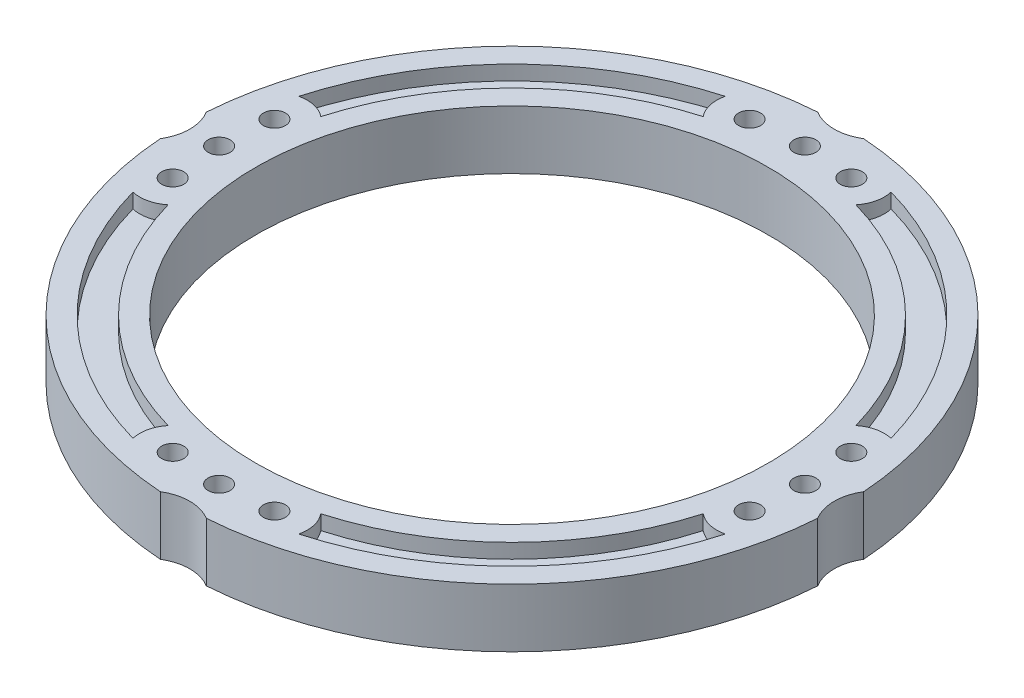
ISO-10303-21;
HEADER;
FILE_DESCRIPTION(('STEP AP214'),'2;1');
FILE_NAME('part.step','',(''),(''),'','','');
FILE_SCHEMA(('AUTOMOTIVE_DESIGN { 1 0 10303 214 1 1 1 1 }'));
ENDSEC;
DATA;
#1=APPLICATION_CONTEXT('core data for automotive mechanical design processes');
#2=APPLICATION_PROTOCOL_DEFINITION('international standard','automotive_design',2000,#1);
#3=PRODUCT_CONTEXT('',#1,'mechanical');
#4=PRODUCT('Part','Part','',(#3));
#5=PRODUCT_RELATED_PRODUCT_CATEGORY('part','',(#4));
#6=PRODUCT_DEFINITION_FORMATION('','',#4);
#7=PRODUCT_DEFINITION_CONTEXT('part definition',#1,'design');
#8=PRODUCT_DEFINITION('design','',#6,#7);
#9=PRODUCT_DEFINITION_SHAPE('','',#8);
#10=(LENGTH_UNIT() NAMED_UNIT(*) SI_UNIT(.MILLI.,.METRE.));
#11=(NAMED_UNIT(*) PLANE_ANGLE_UNIT() SI_UNIT($,.RADIAN.));
#12=(NAMED_UNIT(*) SI_UNIT($,.STERADIAN.) SOLID_ANGLE_UNIT());
#13=UNCERTAINTY_MEASURE_WITH_UNIT(LENGTH_MEASURE(1.E-05),#10,'distance_accuracy_value','');
#14=(GEOMETRIC_REPRESENTATION_CONTEXT(3) GLOBAL_UNCERTAINTY_ASSIGNED_CONTEXT((#13)) GLOBAL_UNIT_ASSIGNED_CONTEXT((#10,
#11,#12)) REPRESENTATION_CONTEXT('',''));
#15=CARTESIAN_POINT('',(0.,0.,0.));
#16=DIRECTION('',(0.,0.,1.));
#17=DIRECTION('',(1.,0.,0.));
#18=AXIS2_PLACEMENT_3D('',#15,#16,#17);
#19=CARTESIAN_POINT('',(0.,8.,0.));
#20=DIRECTION('',(0.,-1.,0.));
#21=DIRECTION('',(0.,0.,-1.));
#22=AXIS2_PLACEMENT_3D('',#19,#20,#21);
#23=CYLINDRICAL_SURFACE('',#22,45.);
#24=CARTESIAN_POINT('',(0.,0.,0.));
#25=DIRECTION('',(0.,1.,0.));
#26=DIRECTION('',(0.,0.,1.));
#27=AXIS2_PLACEMENT_3D('',#24,#25,#26);
#28=CIRCLE('',#27,45.);
#29=CARTESIAN_POINT('',(-3.14450314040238,0.,-44.89));
#30=VERTEX_POINT('',#29);
#31=CARTESIAN_POINT('',(-44.89,0.,-3.14450314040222));
#32=VERTEX_POINT('',#31);
#33=EDGE_CURVE('E314',#30,#32,#28,.T.);
#34=ORIENTED_EDGE('',*,*,#33,.T.);
#35=DIRECTION('',(0.,-1.,0.));
#36=VECTOR('',#35,1.);
#37=CARTESIAN_POINT('',(-44.89,5.,-3.1445031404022));
#38=LINE('',#37,#36);
#39=CARTESIAN_POINT('',(-44.89,8.,-3.14450314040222));
#40=VERTEX_POINT('',#39);
#41=EDGE_CURVE('E11',#32,#40,#38,.F.);
#42=ORIENTED_EDGE('',*,*,#41,.T.);
#43=CARTESIAN_POINT('',(0.,8.,0.));
#44=DIRECTION('',(0.,1.,0.));
#45=DIRECTION('',(0.,0.,1.));
#46=AXIS2_PLACEMENT_3D('',#43,#44,#45);
#47=CIRCLE('',#46,45.);
#48=CARTESIAN_POINT('',(-3.14450314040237,8.,-44.89));
#49=VERTEX_POINT('',#48);
#50=EDGE_CURVE('E369',#49,#40,#47,.T.);
#51=ORIENTED_EDGE('',*,*,#50,.F.);
#52=DIRECTION('',(0.,-1.,0.));
#53=VECTOR('',#52,1.);
#54=CARTESIAN_POINT('',(-3.14450314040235,5.,-44.89));
#55=LINE('',#54,#53);
#56=EDGE_CURVE('E322',#49,#30,#55,.T.);
#57=ORIENTED_EDGE('',*,*,#56,.T.);
#58=EDGE_LOOP('',(#34,#42,#51,#57));
#59=FACE_BOUND('',#58,.T.);
#60=ADVANCED_FACE('F47',(#59),#23,.T.);
#61=CARTESIAN_POINT('',(-44.89,8.,3.14450314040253));
#62=VERTEX_POINT('',#61);
#63=CARTESIAN_POINT('',(-3.14450314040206,8.,44.89));
#64=VERTEX_POINT('',#63);
#65=EDGE_CURVE('E335',#62,#64,#47,.T.);
#66=ORIENTED_EDGE('',*,*,#65,.F.);
#67=DIRECTION('',(0.,-1.,0.));
#68=VECTOR('',#67,1.);
#69=CARTESIAN_POINT('',(-44.89,5.,3.14450314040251));
#70=LINE('',#69,#68);
#71=CARTESIAN_POINT('',(-44.89,0.,3.14450314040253));
#72=VERTEX_POINT('',#71);
#73=EDGE_CURVE('E56',#62,#72,#70,.T.);
#74=ORIENTED_EDGE('',*,*,#73,.T.);
#75=CARTESIAN_POINT('',(-3.14450314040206,0.,44.89));
#76=VERTEX_POINT('',#75);
#77=EDGE_CURVE('E317',#72,#76,#28,.T.);
#78=ORIENTED_EDGE('',*,*,#77,.T.);
#79=DIRECTION('',(0.,-1.,0.));
#80=VECTOR('',#79,1.);
#81=CARTESIAN_POINT('',(-3.14450314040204,5.,44.8900000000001));
#82=LINE('',#81,#80);
#83=EDGE_CURVE('E356',#76,#64,#82,.F.);
#84=ORIENTED_EDGE('',*,*,#83,.T.);
#85=EDGE_LOOP('',(#66,#74,#78,#84));
#86=FACE_BOUND('',#85,.T.);
#87=ADVANCED_FACE('F362',(#86),#23,.T.);
#88=CARTESIAN_POINT('',(3.14450314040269,8.,44.89));
#89=VERTEX_POINT('',#88);
#90=CARTESIAN_POINT('',(44.89,8.,3.1445031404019));
#91=VERTEX_POINT('',#90);
#92=EDGE_CURVE('E336',#89,#91,#47,.T.);
#93=ORIENTED_EDGE('',*,*,#92,.F.);
#94=DIRECTION('',(0.,-1.,0.));
#95=VECTOR('',#94,1.);
#96=CARTESIAN_POINT('',(3.14450314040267,5.,44.89));
#97=LINE('',#96,#95);
#98=CARTESIAN_POINT('',(3.14450314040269,0.,44.89));
#99=VERTEX_POINT('',#98);
#100=EDGE_CURVE('E352',#89,#99,#97,.T.);
#101=ORIENTED_EDGE('',*,*,#100,.T.);
#102=CARTESIAN_POINT('',(44.89,0.,3.1445031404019));
#103=VERTEX_POINT('',#102);
#104=EDGE_CURVE('E329',#99,#103,#28,.T.);
#105=ORIENTED_EDGE('',*,*,#104,.T.);
#106=DIRECTION('',(0.,-1.,0.));
#107=VECTOR('',#106,1.);
#108=CARTESIAN_POINT('',(44.8900000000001,5.,3.14450314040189));
#109=LINE('',#108,#107);
#110=EDGE_CURVE('E348',#103,#91,#109,.F.);
#111=ORIENTED_EDGE('',*,*,#110,.T.);
#112=EDGE_LOOP('',(#93,#101,#105,#111));
#113=FACE_BOUND('',#112,.T.);
#114=ADVANCED_FACE('F841',(#113),#23,.T.);
#115=CARTESIAN_POINT('',(0.,0.,0.));
#116=DIRECTION('',(0.,1.,0.));
#117=DIRECTION('',(0.,0.,1.));
#118=AXIS2_PLACEMENT_3D('',#115,#116,#117);
#119=PLANE('',#118);
#120=CARTESIAN_POINT('',(-39.3923101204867,0.,6.94592710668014));
#121=DIRECTION('',(0.,-1.,0.));
#122=DIRECTION('',(0.,0.,-1.));
#123=AXIS2_PLACEMENT_3D('',#120,#121,#122);
#124=CIRCLE('',#123,4.50000000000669);
#125=CARTESIAN_POINT('',(-36.5412940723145,0.,10.4275513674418));
#126=VERTEX_POINT('',#125);
#127=CARTESIAN_POINT('',(-40.4454696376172,0.,11.3209533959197));
#128=VERTEX_POINT('',#127);
#129=EDGE_CURVE('E444',#126,#128,#124,.T.);
#130=ORIENTED_EDGE('',*,*,#129,.T.);
#131=CARTESIAN_POINT('',(0.,0.,0.));
#132=DIRECTION('',(0.,-1.,0.));
#133=DIRECTION('',(0.,0.,-1.));
#134=AXIS2_PLACEMENT_3D('',#131,#132,#133);
#135=CIRCLE('',#134,42.);
#136=CARTESIAN_POINT('',(-11.3209533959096,0.,40.44546963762));
#137=VERTEX_POINT('',#136);
#138=EDGE_CURVE('E433',#137,#128,#135,.T.);
#139=ORIENTED_EDGE('',*,*,#138,.F.);
#140=CARTESIAN_POINT('',(-6.94592710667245,0.,39.3923101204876));
#141=DIRECTION('',(0.,-1.,0.));
#142=DIRECTION('',(0.,0.,-1.));
#143=AXIS2_PLACEMENT_3D('',#140,#141,#142);
#144=CIRCLE('',#143,4.50000000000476);
#145=CARTESIAN_POINT('',(-10.427551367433,0.,36.541294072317));
#146=VERTEX_POINT('',#145);
#147=EDGE_CURVE('E453',#137,#146,#144,.T.);
#148=ORIENTED_EDGE('',*,*,#147,.T.);
#149=CARTESIAN_POINT('',(0.,0.,0.));
#150=DIRECTION('',(0.,-1.,0.));
#151=DIRECTION('',(0.,0.,-1.));
#152=AXIS2_PLACEMENT_3D('',#149,#150,#151);
#153=CIRCLE('',#152,38.);
#154=EDGE_CURVE('E448',#146,#126,#153,.T.);
#155=ORIENTED_EDGE('',*,*,#154,.T.);
#156=EDGE_LOOP('',(#130,#139,#148,#155));
#157=FACE_BOUND('',#156,.T.);
#158=CARTESIAN_POINT('',(6.94592710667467,0.,-39.392310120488));
#159=DIRECTION('',(0.,-1.,0.));
#160=DIRECTION('',(0.,0.,-1.));
#161=AXIS2_PLACEMENT_3D('',#158,#159,#160);
#162=CIRCLE('',#161,4.50000000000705);
#163=CARTESIAN_POINT('',(11.3209533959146,0.,-40.4454696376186));
#164=VERTEX_POINT('',#163);
#165=CARTESIAN_POINT('',(10.427551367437,0.,-36.5412940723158));
#166=VERTEX_POINT('',#165);
#167=EDGE_CURVE('E419',#164,#166,#162,.T.);
#168=ORIENTED_EDGE('',*,*,#167,.T.);
#169=CARTESIAN_POINT('',(0.,0.,0.));
#170=DIRECTION('',(0.,-1.,0.));
#171=DIRECTION('',(0.,0.,-1.));
#172=AXIS2_PLACEMENT_3D('',#169,#170,#171);
#173=CIRCLE('',#172,38.);
#174=CARTESIAN_POINT('',(36.5412940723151,0.,-10.4275513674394));
#175=VERTEX_POINT('',#174);
#176=EDGE_CURVE('E514',#166,#175,#173,.T.);
#177=ORIENTED_EDGE('',*,*,#176,.T.);
#178=CARTESIAN_POINT('',(39.3923101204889,0.,-6.94592710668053));
#179=DIRECTION('',(0.,-1.,0.));
#180=DIRECTION('',(0.,0.,-1.));
#181=AXIS2_PLACEMENT_3D('',#178,#179,#180);
#182=CIRCLE('',#181,4.50000000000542);
#183=CARTESIAN_POINT('',(40.4454696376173,0.,-11.3209533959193));
#184=VERTEX_POINT('',#183);
#185=EDGE_CURVE('E532',#175,#184,#182,.T.);
#186=ORIENTED_EDGE('',*,*,#185,.T.);
#187=CARTESIAN_POINT('',(0.,0.,0.));
#188=DIRECTION('',(0.,-1.,0.));
#189=DIRECTION('',(0.,0.,-1.));
#190=AXIS2_PLACEMENT_3D('',#187,#188,#189);
#191=CIRCLE('',#190,42.);
#192=EDGE_CURVE('E528',#164,#184,#191,.T.);
#193=ORIENTED_EDGE('',*,*,#192,.F.);
#194=EDGE_LOOP('',(#168,#177,#186,#193));
#195=FACE_BOUND('',#194,.T.);
#196=ORIENTED_EDGE('',*,*,#77,.F.);
#197=CARTESIAN_POINT('',(-50.,0.,1.74574066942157E-13));
#198=DIRECTION('',(0.,-1.,0.));
#199=DIRECTION('',(0.,0.,-1.));
#200=AXIS2_PLACEMENT_3D('',#197,#198,#199);
#201=CIRCLE('',#200,6.);
#202=EDGE_CURVE('E63',#32,#72,#201,.T.);
#203=ORIENTED_EDGE('',*,*,#202,.F.);
#204=ORIENTED_EDGE('',*,*,#33,.F.);
#205=CARTESIAN_POINT('',(0.,0.,-50.));
#206=DIRECTION('',(0.,-1.,0.));
#207=DIRECTION('',(0.,0.,-1.));
#208=AXIS2_PLACEMENT_3D('',#205,#206,#207);
#209=CIRCLE('',#208,6.);
#210=CARTESIAN_POINT('',(3.14450314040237,0.,-44.89));
#211=VERTEX_POINT('',#210);
#212=EDGE_CURVE('E71',#211,#30,#209,.T.);
#213=ORIENTED_EDGE('',*,*,#212,.F.);
#214=CARTESIAN_POINT('',(44.89,0.,-3.14450314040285));
#215=VERTEX_POINT('',#214);
#216=EDGE_CURVE('E324',#215,#211,#28,.T.);
#217=ORIENTED_EDGE('',*,*,#216,.F.);
#218=CARTESIAN_POINT('',(50.,0.,-5.2372220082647E-13));
#219=DIRECTION('',(0.,-1.,0.));
#220=DIRECTION('',(0.,0.,-1.));
#221=AXIS2_PLACEMENT_3D('',#218,#219,#220);
#222=CIRCLE('',#221,6.);
#223=EDGE_CURVE('E871',#103,#215,#222,.T.);
#224=ORIENTED_EDGE('',*,*,#223,.F.);
#225=ORIENTED_EDGE('',*,*,#104,.F.);
#226=CARTESIAN_POINT('',(3.49148133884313E-13,0.,50.));
#227=DIRECTION('',(0.,-1.,0.));
#228=DIRECTION('',(0.,0.,-1.));
#229=AXIS2_PLACEMENT_3D('',#226,#227,#228);
#230=CIRCLE('',#229,6.);
#231=EDGE_CURVE('E320',#76,#99,#230,.T.);
#232=ORIENTED_EDGE('',*,*,#231,.F.);
#233=EDGE_LOOP('',(#196,#203,#204,#213,#217,#224,#225,#232));
#234=FACE_BOUND('',#233,.T.);
#235=CARTESIAN_POINT('',(0.,0.,-40.));
#236=DIRECTION('',(0.,1.,0.));
#237=DIRECTION('',(0.,0.,1.));
#238=AXIS2_PLACEMENT_3D('',#235,#236,#237);
#239=CIRCLE('',#238,1.5);
#240=CARTESIAN_POINT('',(0.,0.,-38.5));
#241=VERTEX_POINT('',#240);
#242=EDGE_CURVE('E817',#241,#241,#239,.T.);
#243=ORIENTED_EDGE('',*,*,#242,.T.);
#244=EDGE_LOOP('',(#243));
#245=FACE_BOUND('',#244,.T.);
#246=CARTESIAN_POINT('',(0.,0.,0.));
#247=DIRECTION('',(0.,1.,0.));
#248=DIRECTION('',(0.,0.,1.));
#249=AXIS2_PLACEMENT_3D('',#246,#247,#248);
#250=CIRCLE('',#249,35.);
#251=CARTESIAN_POINT('',(0.,0.,35.));
#252=VERTEX_POINT('',#251);
#253=EDGE_CURVE('E809',#252,#252,#250,.T.);
#254=ORIENTED_EDGE('',*,*,#253,.T.);
#255=EDGE_LOOP('',(#254));
#256=FACE_BOUND('',#255,.T.);
#257=CARTESIAN_POINT('',(40.,0.,1.39659253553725E-13));
#258=DIRECTION('',(0.,1.,0.));
#259=DIRECTION('',(0.,0.,1.));
#260=AXIS2_PLACEMENT_3D('',#257,#258,#259);
#261=CIRCLE('',#260,1.5);
#262=CARTESIAN_POINT('',(40.,0.,1.50000000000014));
#263=VERTEX_POINT('',#262);
#264=EDGE_CURVE('E801',#263,#263,#261,.T.);
#265=ORIENTED_EDGE('',*,*,#264,.T.);
#266=EDGE_LOOP('',(#265));
#267=FACE_BOUND('',#266,.T.);
#268=CARTESIAN_POINT('',(-2.79318507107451E-13,0.,40.));
#269=DIRECTION('',(0.,1.,0.));
#270=DIRECTION('',(0.,0.,1.));
#271=AXIS2_PLACEMENT_3D('',#268,#269,#270);
#272=CIRCLE('',#271,1.5);
#273=CARTESIAN_POINT('',(-2.79318507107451E-13,0.,41.5));
#274=VERTEX_POINT('',#273);
#275=EDGE_CURVE('E793',#274,#274,#272,.T.);
#276=ORIENTED_EDGE('',*,*,#275,.T.);
#277=EDGE_LOOP('',(#276));
#278=FACE_BOUND('',#277,.T.);
#279=CARTESIAN_POINT('',(-40.,0.,-4.18977760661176E-13));
#280=DIRECTION('',(0.,1.,0.));
#281=DIRECTION('',(0.,0.,1.));
#282=AXIS2_PLACEMENT_3D('',#279,#280,#281);
#283=CIRCLE('',#282,1.5);
#284=CARTESIAN_POINT('',(-40.,0.,1.49999999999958));
#285=VERTEX_POINT('',#284);
#286=EDGE_CURVE('E785',#285,#285,#283,.T.);
#287=ORIENTED_EDGE('',*,*,#286,.T.);
#288=EDGE_LOOP('',(#287));
#289=FACE_BOUND('',#288,.T.);
#290=CARTESIAN_POINT('',(6.94592710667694,0.,-39.3923101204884));
#291=DIRECTION('',(0.,1.,0.));
#292=DIRECTION('',(0.,0.,1.));
#293=AXIS2_PLACEMENT_3D('',#290,#291,#292);
#294=CIRCLE('',#293,1.5);
#295=CARTESIAN_POINT('',(6.94592710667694,0.,-37.8923101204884));
#296=VERTEX_POINT('',#295);
#297=EDGE_CURVE('E777',#296,#296,#294,.T.);
#298=ORIENTED_EDGE('',*,*,#297,.T.);
#299=EDGE_LOOP('',(#298));
#300=FACE_BOUND('',#299,.T.);
#301=CARTESIAN_POINT('',(-6.94592710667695,0.,-39.3923101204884));
#302=DIRECTION('',(0.,1.,0.));
#303=DIRECTION('',(0.,0.,1.));
#304=AXIS2_PLACEMENT_3D('',#301,#302,#303);
#305=CIRCLE('',#304,1.5);
#306=CARTESIAN_POINT('',(-6.94592710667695,0.,-37.8923101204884));
#307=VERTEX_POINT('',#306);
#308=EDGE_CURVE('E769',#307,#307,#305,.T.);
#309=ORIENTED_EDGE('',*,*,#308,.T.);
#310=EDGE_LOOP('',(#309));
#311=FACE_BOUND('',#310,.T.);
#312=CARTESIAN_POINT('',(39.3923101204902,0.,6.9459271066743));
#313=DIRECTION('',(0.,1.,0.));
#314=DIRECTION('',(0.,0.,1.));
#315=AXIS2_PLACEMENT_3D('',#312,#313,#314);
#316=CIRCLE('',#315,1.50000000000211);
#317=CARTESIAN_POINT('',(39.3923101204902,0.,8.44592710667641));
#318=VERTEX_POINT('',#317);
#319=EDGE_CURVE('E761',#318,#318,#316,.T.);
#320=ORIENTED_EDGE('',*,*,#319,.T.);
#321=EDGE_LOOP('',(#320));
#322=FACE_BOUND('',#321,.T.);
#323=CARTESIAN_POINT('',(39.3923101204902,0.,-6.94592710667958));
#324=DIRECTION('',(0.,1.,0.));
#325=DIRECTION('',(0.,0.,1.));
#326=AXIS2_PLACEMENT_3D('',#323,#324,#325);
#327=CIRCLE('',#326,1.50000000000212);
#328=CARTESIAN_POINT('',(39.3923101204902,0.,-5.44592710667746));
#329=VERTEX_POINT('',#328);
#330=EDGE_CURVE('E753',#329,#329,#327,.T.);
#331=ORIENTED_EDGE('',*,*,#330,.T.);
#332=EDGE_LOOP('',(#331));
#333=FACE_BOUND('',#332,.T.);
#334=CARTESIAN_POINT('',(-6.94592710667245,0.,39.3923101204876));
#335=DIRECTION('',(0.,1.,0.));
#336=DIRECTION('',(0.,0.,1.));
#337=AXIS2_PLACEMENT_3D('',#334,#335,#336);
#338=CIRCLE('',#337,1.50000000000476);
#339=CARTESIAN_POINT('',(-6.94592710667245,0.,40.8923101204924));
#340=VERTEX_POINT('',#339);
#341=EDGE_CURVE('E745',#340,#340,#338,.T.);
#342=ORIENTED_EDGE('',*,*,#341,.T.);
#343=EDGE_LOOP('',(#342));
#344=FACE_BOUND('',#343,.T.);
#345=CARTESIAN_POINT('',(6.94592710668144,0.,39.3923101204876));
#346=DIRECTION('',(0.,1.,0.));
#347=DIRECTION('',(0.,0.,1.));
#348=AXIS2_PLACEMENT_3D('',#345,#346,#347);
#349=CIRCLE('',#348,1.50000000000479);
#350=CARTESIAN_POINT('',(6.94592710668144,0.,40.8923101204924));
#351=VERTEX_POINT('',#350);
#352=EDGE_CURVE('E737',#351,#351,#349,.T.);
#353=ORIENTED_EDGE('',*,*,#352,.T.);
#354=EDGE_LOOP('',(#353));
#355=FACE_BOUND('',#354,.T.);
#356=CARTESIAN_POINT('',(-39.3923101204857,0.,-6.94592710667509));
#357=DIRECTION('',(0.,1.,0.));
#358=DIRECTION('',(0.,0.,1.));
#359=AXIS2_PLACEMENT_3D('',#356,#357,#358);
#360=CIRCLE('',#359,1.5000000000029);
#361=CARTESIAN_POINT('',(-39.3923101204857,0.,-5.44592710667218));
#362=VERTEX_POINT('',#361);
#363=EDGE_CURVE('E729',#362,#362,#360,.T.);
#364=ORIENTED_EDGE('',*,*,#363,.T.);
#365=EDGE_LOOP('',(#364));
#366=FACE_BOUND('',#365,.T.);
#367=CARTESIAN_POINT('',(-39.3923101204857,0.,6.9459271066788));
#368=DIRECTION('',(0.,1.,0.));
#369=DIRECTION('',(0.,0.,1.));
#370=AXIS2_PLACEMENT_3D('',#367,#368,#369);
#371=CIRCLE('',#370,1.50000000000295);
#372=CARTESIAN_POINT('',(-39.3923101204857,0.,8.44592710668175));
#373=VERTEX_POINT('',#372);
#374=EDGE_CURVE('E715',#373,#373,#371,.T.);
#375=ORIENTED_EDGE('',*,*,#374,.T.);
#376=EDGE_LOOP('',(#375));
#377=FACE_BOUND('',#376,.T.);
#378=CARTESIAN_POINT('',(-39.3923101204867,0.,-6.94592710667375));
#379=DIRECTION('',(0.,-1.,0.));
#380=DIRECTION('',(0.,0.,-1.));
#381=AXIS2_PLACEMENT_3D('',#378,#379,#380);
#382=CIRCLE('',#381,4.5000000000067);
#383=CARTESIAN_POINT('',(-40.4454696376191,0.,-11.3209533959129));
#384=VERTEX_POINT('',#383);
#385=CARTESIAN_POINT('',(-36.5412940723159,0.,-10.4275513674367));
#386=VERTEX_POINT('',#385);
#387=EDGE_CURVE('E399',#384,#386,#382,.T.);
#388=ORIENTED_EDGE('',*,*,#387,.T.);
#389=CARTESIAN_POINT('',(0.,0.,0.));
#390=DIRECTION('',(0.,-1.,0.));
#391=DIRECTION('',(0.,0.,-1.));
#392=AXIS2_PLACEMENT_3D('',#389,#390,#391);
#393=CIRCLE('',#392,38.);
#394=CARTESIAN_POINT('',(-10.4275513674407,0.,-36.5412940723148));
#395=VERTEX_POINT('',#394);
#396=EDGE_CURVE('E388',#386,#395,#393,.T.);
#397=ORIENTED_EDGE('',*,*,#396,.T.);
#398=CARTESIAN_POINT('',(-6.94592710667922,0.,-39.392310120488));
#399=DIRECTION('',(0.,-1.,0.));
#400=DIRECTION('',(0.,0.,-1.));
#401=AXIS2_PLACEMENT_3D('',#398,#399,#400);
#402=CIRCLE('',#401,4.50000000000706);
#403=CARTESIAN_POINT('',(-11.3209533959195,0.,-40.4454696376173));
#404=VERTEX_POINT('',#403);
#405=EDGE_CURVE('E408',#395,#404,#402,.T.);
#406=ORIENTED_EDGE('',*,*,#405,.T.);
#407=CARTESIAN_POINT('',(0.,0.,0.));
#408=DIRECTION('',(0.,-1.,0.));
#409=DIRECTION('',(0.,0.,-1.));
#410=AXIS2_PLACEMENT_3D('',#407,#408,#409);
#411=CIRCLE('',#410,42.);
#412=EDGE_CURVE('E403',#384,#404,#411,.T.);
#413=ORIENTED_EDGE('',*,*,#412,.F.);
#414=EDGE_LOOP('',(#388,#397,#406,#413));
#415=FACE_BOUND('',#414,.T.);
#416=CARTESIAN_POINT('',(39.3923101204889,0.,6.94592710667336));
#417=DIRECTION('',(0.,-1.,0.));
#418=DIRECTION('',(0.,0.,-1.));
#419=AXIS2_PLACEMENT_3D('',#416,#417,#418);
#420=CIRCLE('',#419,4.5000000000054);
#421=CARTESIAN_POINT('',(40.4454696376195,0.,11.3209533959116));
#422=VERTEX_POINT('',#421);
#423=CARTESIAN_POINT('',(36.5412940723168,0.,10.4275513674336));
#424=VERTEX_POINT('',#423);
#425=EDGE_CURVE('E371',#422,#424,#420,.T.);
#426=ORIENTED_EDGE('',*,*,#425,.T.);
#427=CARTESIAN_POINT('',(0.,0.,0.));
#428=DIRECTION('',(0.,-1.,0.));
#429=DIRECTION('',(0.,0.,-1.));
#430=AXIS2_PLACEMENT_3D('',#427,#428,#429);
#431=CIRCLE('',#430,38.);
#432=CARTESIAN_POINT('',(10.4275513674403,0.,36.5412940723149));
#433=VERTEX_POINT('',#432);
#434=EDGE_CURVE('E476',#424,#433,#431,.T.);
#435=ORIENTED_EDGE('',*,*,#434,.T.);
#436=CARTESIAN_POINT('',(6.94592710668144,0.,39.3923101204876));
#437=DIRECTION('',(0.,-1.,0.));
#438=DIRECTION('',(0.,0.,-1.));
#439=AXIS2_PLACEMENT_3D('',#436,#437,#438);
#440=CIRCLE('',#439,4.5000000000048);
#441=CARTESIAN_POINT('',(11.3209533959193,0.,40.4454696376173));
#442=VERTEX_POINT('',#441);
#443=EDGE_CURVE('E490',#433,#442,#440,.T.);
#444=ORIENTED_EDGE('',*,*,#443,.T.);
#445=CARTESIAN_POINT('',(0.,0.,0.));
#446=DIRECTION('',(0.,-1.,0.));
#447=DIRECTION('',(0.,0.,-1.));
#448=AXIS2_PLACEMENT_3D('',#445,#446,#447);
#449=CIRCLE('',#448,42.);
#450=EDGE_CURVE('E377',#422,#442,#449,.T.);
#451=ORIENTED_EDGE('',*,*,#450,.F.);
#452=EDGE_LOOP('',(#426,#435,#444,#451));
#453=FACE_BOUND('',#452,.T.);
#454=ADVANCED_FACE('F312',(#157,#195,#234,#245,#256,#267,#278,#289,#300,#311,#322,#333,#344,
#355,#366,#377,#415,#453),#119,.F.);
#455=CARTESIAN_POINT('',(0.,8.,0.));
#456=DIRECTION('',(0.,1.,0.));
#457=DIRECTION('',(0.,0.,1.));
#458=AXIS2_PLACEMENT_3D('',#455,#456,#457);
#459=PLANE('',#458);
#460=CARTESIAN_POINT('',(-50.,8.,1.74574066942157E-13));
#461=DIRECTION('',(0.,1.,0.));
#462=DIRECTION('',(0.,0.,1.));
#463=AXIS2_PLACEMENT_3D('',#460,#461,#462);
#464=CIRCLE('',#463,6.);
#465=EDGE_CURVE('E304',#62,#40,#464,.T.);
#466=ORIENTED_EDGE('',*,*,#465,.F.);
#467=ORIENTED_EDGE('',*,*,#65,.T.);
#468=CARTESIAN_POINT('',(3.49148133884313E-13,8.,50.));
#469=DIRECTION('',(0.,1.,0.));
#470=DIRECTION('',(0.,0.,1.));
#471=AXIS2_PLACEMENT_3D('',#468,#469,#470);
#472=CIRCLE('',#471,6.);
#473=EDGE_CURVE('E372',#89,#64,#472,.T.);
#474=ORIENTED_EDGE('',*,*,#473,.F.);
#475=ORIENTED_EDGE('',*,*,#92,.T.);
#476=CARTESIAN_POINT('',(50.,8.,-5.2372220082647E-13));
#477=DIRECTION('',(0.,1.,0.));
#478=DIRECTION('',(0.,0.,1.));
#479=AXIS2_PLACEMENT_3D('',#476,#477,#478);
#480=CIRCLE('',#479,6.);
#481=CARTESIAN_POINT('',(44.89,8.,-3.14450314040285));
#482=VERTEX_POINT('',#481);
#483=EDGE_CURVE('E379',#482,#91,#480,.T.);
#484=ORIENTED_EDGE('',*,*,#483,.F.);
#485=CARTESIAN_POINT('',(3.14450314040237,8.,-44.89));
#486=VERTEX_POINT('',#485);
#487=EDGE_CURVE('E861',#482,#486,#47,.T.);
#488=ORIENTED_EDGE('',*,*,#487,.T.);
#489=CARTESIAN_POINT('',(0.,8.,-50.));
#490=DIRECTION('',(0.,1.,0.));
#491=DIRECTION('',(0.,0.,1.));
#492=AXIS2_PLACEMENT_3D('',#489,#490,#491);
#493=CIRCLE('',#492,6.);
#494=EDGE_CURVE('E319',#49,#486,#493,.T.);
#495=ORIENTED_EDGE('',*,*,#494,.F.);
#496=ORIENTED_EDGE('',*,*,#50,.T.);
#497=EDGE_LOOP('',(#466,#467,#474,#475,#484,#488,#495,#496));
#498=FACE_BOUND('',#497,.T.);
#499=CARTESIAN_POINT('',(-39.3923101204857,8.,-6.94592710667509));
#500=DIRECTION('',(0.,1.,0.));
#501=DIRECTION('',(0.,0.,1.));
#502=AXIS2_PLACEMENT_3D('',#499,#500,#501);
#503=CIRCLE('',#502,1.5000000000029);
#504=CARTESIAN_POINT('',(-39.3923101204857,8.,-5.44592710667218));
#505=VERTEX_POINT('',#504);
#506=EDGE_CURVE('E733',#505,#505,#503,.T.);
#507=ORIENTED_EDGE('',*,*,#506,.F.);
#508=EDGE_LOOP('',(#507));
#509=FACE_BOUND('',#508,.T.);
#510=CARTESIAN_POINT('',(-6.94592710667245,8.,39.3923101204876));
#511=DIRECTION('',(0.,1.,0.));
#512=DIRECTION('',(0.,0.,1.));
#513=AXIS2_PLACEMENT_3D('',#510,#511,#512);
#514=CIRCLE('',#513,1.50000000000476);
#515=CARTESIAN_POINT('',(-6.94592710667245,8.,40.8923101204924));
#516=VERTEX_POINT('',#515);
#517=EDGE_CURVE('E749',#516,#516,#514,.T.);
#518=ORIENTED_EDGE('',*,*,#517,.F.);
#519=EDGE_LOOP('',(#518));
#520=FACE_BOUND('',#519,.T.);
#521=CARTESIAN_POINT('',(39.3923101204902,8.,6.9459271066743));
#522=DIRECTION('',(0.,1.,0.));
#523=DIRECTION('',(0.,0.,1.));
#524=AXIS2_PLACEMENT_3D('',#521,#522,#523);
#525=CIRCLE('',#524,1.50000000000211);
#526=CARTESIAN_POINT('',(39.3923101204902,8.,8.44592710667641));
#527=VERTEX_POINT('',#526);
#528=EDGE_CURVE('E765',#527,#527,#525,.T.);
#529=ORIENTED_EDGE('',*,*,#528,.F.);
#530=EDGE_LOOP('',(#529));
#531=FACE_BOUND('',#530,.T.);
#532=CARTESIAN_POINT('',(6.94592710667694,8.,-39.3923101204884));
#533=DIRECTION('',(0.,1.,0.));
#534=DIRECTION('',(0.,0.,1.));
#535=AXIS2_PLACEMENT_3D('',#532,#533,#534);
#536=CIRCLE('',#535,1.5);
#537=CARTESIAN_POINT('',(6.94592710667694,8.,-37.8923101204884));
#538=VERTEX_POINT('',#537);
#539=EDGE_CURVE('E781',#538,#538,#536,.T.);
#540=ORIENTED_EDGE('',*,*,#539,.F.);
#541=EDGE_LOOP('',(#540));
#542=FACE_BOUND('',#541,.T.);
#543=CARTESIAN_POINT('',(-2.79318507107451E-13,8.,40.));
#544=DIRECTION('',(0.,1.,0.));
#545=DIRECTION('',(0.,0.,1.));
#546=AXIS2_PLACEMENT_3D('',#543,#544,#545);
#547=CIRCLE('',#546,1.5);
#548=CARTESIAN_POINT('',(-2.79318507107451E-13,8.,41.5));
#549=VERTEX_POINT('',#548);
#550=EDGE_CURVE('E797',#549,#549,#547,.T.);
#551=ORIENTED_EDGE('',*,*,#550,.F.);
#552=EDGE_LOOP('',(#551));
#553=FACE_BOUND('',#552,.T.);
#554=CARTESIAN_POINT('',(0.,8.,0.));
#555=DIRECTION('',(0.,1.,0.));
#556=DIRECTION('',(0.,0.,1.));
#557=AXIS2_PLACEMENT_3D('',#554,#555,#556);
#558=CIRCLE('',#557,35.);
#559=CARTESIAN_POINT('',(0.,8.,35.));
#560=VERTEX_POINT('',#559);
#561=EDGE_CURVE('E813',#560,#560,#558,.T.);
#562=ORIENTED_EDGE('',*,*,#561,.F.);
#563=EDGE_LOOP('',(#562));
#564=FACE_BOUND('',#563,.T.);
#565=CARTESIAN_POINT('',(0.,8.,-40.));
#566=DIRECTION('',(0.,1.,0.));
#567=DIRECTION('',(0.,0.,1.));
#568=AXIS2_PLACEMENT_3D('',#565,#566,#567);
#569=CIRCLE('',#568,1.5);
#570=CARTESIAN_POINT('',(0.,8.,-38.5));
#571=VERTEX_POINT('',#570);
#572=EDGE_CURVE('E330',#571,#571,#569,.T.);
#573=ORIENTED_EDGE('',*,*,#572,.F.);
#574=EDGE_LOOP('',(#573));
#575=FACE_BOUND('',#574,.T.);
#576=CARTESIAN_POINT('',(40.,8.,1.39659253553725E-13));
#577=DIRECTION('',(0.,1.,0.));
#578=DIRECTION('',(0.,0.,1.));
#579=AXIS2_PLACEMENT_3D('',#576,#577,#578);
#580=CIRCLE('',#579,1.5);
#581=CARTESIAN_POINT('',(40.,8.,1.50000000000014));
#582=VERTEX_POINT('',#581);
#583=EDGE_CURVE('E805',#582,#582,#580,.T.);
#584=ORIENTED_EDGE('',*,*,#583,.F.);
#585=EDGE_LOOP('',(#584));
#586=FACE_BOUND('',#585,.T.);
#587=CARTESIAN_POINT('',(-40.,8.,-4.18977760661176E-13));
#588=DIRECTION('',(0.,1.,0.));
#589=DIRECTION('',(0.,0.,1.));
#590=AXIS2_PLACEMENT_3D('',#587,#588,#589);
#591=CIRCLE('',#590,1.5);
#592=CARTESIAN_POINT('',(-40.,8.,1.49999999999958));
#593=VERTEX_POINT('',#592);
#594=EDGE_CURVE('E789',#593,#593,#591,.T.);
#595=ORIENTED_EDGE('',*,*,#594,.F.);
#596=EDGE_LOOP('',(#595));
#597=FACE_BOUND('',#596,.T.);
#598=CARTESIAN_POINT('',(-6.94592710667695,8.,-39.3923101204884));
#599=DIRECTION('',(0.,1.,0.));
#600=DIRECTION('',(0.,0.,1.));
#601=AXIS2_PLACEMENT_3D('',#598,#599,#600);
#602=CIRCLE('',#601,1.5);
#603=CARTESIAN_POINT('',(-6.94592710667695,8.,-37.8923101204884));
#604=VERTEX_POINT('',#603);
#605=EDGE_CURVE('E773',#604,#604,#602,.T.);
#606=ORIENTED_EDGE('',*,*,#605,.F.);
#607=EDGE_LOOP('',(#606));
#608=FACE_BOUND('',#607,.T.);
#609=CARTESIAN_POINT('',(39.3923101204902,8.,-6.94592710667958));
#610=DIRECTION('',(0.,1.,0.));
#611=DIRECTION('',(0.,0.,1.));
#612=AXIS2_PLACEMENT_3D('',#609,#610,#611);
#613=CIRCLE('',#612,1.50000000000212);
#614=CARTESIAN_POINT('',(39.3923101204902,8.,-5.44592710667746));
#615=VERTEX_POINT('',#614);
#616=EDGE_CURVE('E757',#615,#615,#613,.T.);
#617=ORIENTED_EDGE('',*,*,#616,.F.);
#618=EDGE_LOOP('',(#617));
#619=FACE_BOUND('',#618,.T.);
#620=CARTESIAN_POINT('',(6.94592710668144,8.,39.3923101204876));
#621=DIRECTION('',(0.,1.,0.));
#622=DIRECTION('',(0.,0.,1.));
#623=AXIS2_PLACEMENT_3D('',#620,#621,#622);
#624=CIRCLE('',#623,1.50000000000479);
#625=CARTESIAN_POINT('',(6.94592710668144,8.,40.8923101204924));
#626=VERTEX_POINT('',#625);
#627=EDGE_CURVE('E741',#626,#626,#624,.T.);
#628=ORIENTED_EDGE('',*,*,#627,.F.);
#629=EDGE_LOOP('',(#628));
#630=FACE_BOUND('',#629,.T.);
#631=CARTESIAN_POINT('',(-39.3923101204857,8.,6.9459271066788));
#632=DIRECTION('',(0.,1.,0.));
#633=DIRECTION('',(0.,0.,1.));
#634=AXIS2_PLACEMENT_3D('',#631,#632,#633);
#635=CIRCLE('',#634,1.50000000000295);
#636=CARTESIAN_POINT('',(-39.3923101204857,8.,8.44592710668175));
#637=VERTEX_POINT('',#636);
#638=EDGE_CURVE('E725',#637,#637,#635,.T.);
#639=ORIENTED_EDGE('',*,*,#638,.F.);
#640=EDGE_LOOP('',(#639));
#641=FACE_BOUND('',#640,.T.);
#642=CARTESIAN_POINT('',(0.,8.,0.));
#643=DIRECTION('',(0.,1.,0.));
#644=DIRECTION('',(0.,0.,1.));
#645=AXIS2_PLACEMENT_3D('',#642,#643,#644);
#646=CIRCLE('',#645,38.);
#647=CARTESIAN_POINT('',(-10.4275513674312,8.,-36.5412940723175));
#648=VERTEX_POINT('',#647);
#649=CARTESIAN_POINT('',(-36.541294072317,8.,-10.427551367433));
#650=VERTEX_POINT('',#649);
#651=EDGE_CURVE('E701',#648,#650,#646,.T.);
#652=ORIENTED_EDGE('',*,*,#651,.T.);
#653=CARTESIAN_POINT('',(-39.3923101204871,8.,-6.94592710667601));
#654=DIRECTION('',(0.,1.,0.));
#655=DIRECTION('',(0.,0.,1.));
#656=AXIS2_PLACEMENT_3D('',#653,#654,#655);
#657=CIRCLE('',#656,4.50000000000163);
#658=CARTESIAN_POINT('',(-40.44546963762,8.,-11.3209533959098));
#659=VERTEX_POINT('',#658);
#660=EDGE_CURVE('E587',#650,#659,#657,.T.);
#661=ORIENTED_EDGE('',*,*,#660,.T.);
#662=CARTESIAN_POINT('',(0.,8.,0.));
#663=DIRECTION('',(0.,1.,0.));
#664=DIRECTION('',(0.,0.,1.));
#665=AXIS2_PLACEMENT_3D('',#662,#663,#664);
#666=CIRCLE('',#665,42.);
#667=CARTESIAN_POINT('',(-11.3209533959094,8.,-40.4454696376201));
#668=VERTEX_POINT('',#667);
#669=EDGE_CURVE('E687',#668,#659,#666,.T.);
#670=ORIENTED_EDGE('',*,*,#669,.F.);
#671=CARTESIAN_POINT('',(-6.94592710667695,8.,-39.3923101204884));
#672=DIRECTION('',(0.,1.,0.));
#673=DIRECTION('',(0.,0.,1.));
#674=AXIS2_PLACEMENT_3D('',#671,#672,#673);
#675=CIRCLE('',#674,4.5);
#676=EDGE_CURVE('E705',#668,#648,#675,.T.);
#677=ORIENTED_EDGE('',*,*,#676,.T.);
#678=EDGE_LOOP('',(#652,#661,#670,#677));
#679=FACE_BOUND('',#678,.T.);
#680=CARTESIAN_POINT('',(0.,8.,0.));
#681=DIRECTION('',(0.,1.,0.));
#682=DIRECTION('',(0.,0.,1.));
#683=AXIS2_PLACEMENT_3D('',#680,#681,#682);
#684=CIRCLE('',#683,38.);
#685=CARTESIAN_POINT('',(36.541294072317,8.,-10.4275513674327));
#686=VERTEX_POINT('',#685);
#687=CARTESIAN_POINT('',(10.4275513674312,8.,-36.5412940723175));
#688=VERTEX_POINT('',#687);
#689=EDGE_CURVE('E572',#686,#688,#684,.T.);
#690=ORIENTED_EDGE('',*,*,#689,.T.);
#691=CARTESIAN_POINT('',(6.94592710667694,8.,-39.3923101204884));
#692=DIRECTION('',(0.,1.,0.));
#693=DIRECTION('',(0.,0.,1.));
#694=AXIS2_PLACEMENT_3D('',#691,#692,#693);
#695=CIRCLE('',#694,4.5);
#696=CARTESIAN_POINT('',(11.3209533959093,8.,-40.4454696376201));
#697=VERTEX_POINT('',#696);
#698=EDGE_CURVE('E568',#688,#697,#695,.T.);
#699=ORIENTED_EDGE('',*,*,#698,.T.);
#700=CARTESIAN_POINT('',(0.,8.,0.));
#701=DIRECTION('',(0.,1.,0.));
#702=DIRECTION('',(0.,0.,1.));
#703=AXIS2_PLACEMENT_3D('',#700,#701,#702);
#704=CIRCLE('',#703,42.);
#705=CARTESIAN_POINT('',(40.4454696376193,8.,-11.3209533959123));
#706=VERTEX_POINT('',#705);
#707=EDGE_CURVE('E557',#706,#697,#704,.T.);
#708=ORIENTED_EDGE('',*,*,#707,.F.);
#709=CARTESIAN_POINT('',(39.3923101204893,8.,-6.94592710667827));
#710=DIRECTION('',(0.,1.,0.));
#711=DIRECTION('',(0.,0.,1.));
#712=AXIS2_PLACEMENT_3D('',#709,#710,#711);
#713=CIRCLE('',#712,4.50000000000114);
#714=EDGE_CURVE('E577',#706,#686,#713,.T.);
#715=ORIENTED_EDGE('',*,*,#714,.T.);
#716=EDGE_LOOP('',(#690,#699,#708,#715));
#717=FACE_BOUND('',#716,.T.);
#718=CARTESIAN_POINT('',(0.,8.,0.));
#719=DIRECTION('',(0.,1.,0.));
#720=DIRECTION('',(0.,0.,1.));
#721=AXIS2_PLACEMENT_3D('',#718,#719,#720);
#722=CIRCLE('',#721,42.);
#723=CARTESIAN_POINT('',(11.3209533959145,8.,40.4454696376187));
#724=VERTEX_POINT('',#723);
#725=CARTESIAN_POINT('',(40.4454696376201,8.,11.3209533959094));
#726=VERTEX_POINT('',#725);
#727=EDGE_CURVE('E617',#724,#726,#722,.T.);
#728=ORIENTED_EDGE('',*,*,#727,.F.);
#729=CARTESIAN_POINT('',(6.9459271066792,8.,39.392310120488));
#730=DIRECTION('',(0.,1.,0.));
#731=DIRECTION('',(0.,0.,1.));
#732=AXIS2_PLACEMENT_3D('',#729,#730,#731);
#733=CIRCLE('',#732,4.50000000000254);
#734=CARTESIAN_POINT('',(10.4275513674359,8.,36.5412940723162));
#735=VERTEX_POINT('',#734);
#736=EDGE_CURVE('E613',#724,#735,#733,.T.);
#737=ORIENTED_EDGE('',*,*,#736,.T.);
#738=CARTESIAN_POINT('',(0.,8.,0.));
#739=DIRECTION('',(0.,1.,0.));
#740=DIRECTION('',(0.,0.,1.));
#741=AXIS2_PLACEMENT_3D('',#738,#739,#740);
#742=CIRCLE('',#741,38.);
#743=CARTESIAN_POINT('',(36.5412940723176,8.,10.4275513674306));
#744=VERTEX_POINT('',#743);
#745=EDGE_CURVE('E602',#735,#744,#742,.T.);
#746=ORIENTED_EDGE('',*,*,#745,.T.);
#747=CARTESIAN_POINT('',(39.3923101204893,8.,6.94592710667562));
#748=DIRECTION('',(0.,1.,0.));
#749=DIRECTION('',(0.,0.,1.));
#750=AXIS2_PLACEMENT_3D('',#747,#748,#749);
#751=CIRCLE('',#750,4.50000000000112);
#752=EDGE_CURVE('E622',#744,#726,#751,.T.);
#753=ORIENTED_EDGE('',*,*,#752,.T.);
#754=EDGE_LOOP('',(#728,#737,#746,#753));
#755=FACE_BOUND('',#754,.T.);
#756=CARTESIAN_POINT('',(0.,8.,0.));
#757=DIRECTION('',(0.,1.,0.));
#758=DIRECTION('',(0.,0.,1.));
#759=AXIS2_PLACEMENT_3D('',#756,#757,#758);
#760=CIRCLE('',#759,42.);
#761=CARTESIAN_POINT('',(-40.4454696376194,8.,11.3209533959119));
#762=VERTEX_POINT('',#761);
#763=CARTESIAN_POINT('',(-11.3209533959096,8.,40.44546963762));
#764=VERTEX_POINT('',#763);
#765=EDGE_CURVE('E660',#762,#764,#760,.T.);
#766=ORIENTED_EDGE('',*,*,#765,.F.);
#767=CARTESIAN_POINT('',(-39.3923101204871,8.,6.94592710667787));
#768=DIRECTION('',(0.,1.,0.));
#769=DIRECTION('',(0.,0.,1.));
#770=AXIS2_PLACEMENT_3D('',#767,#768,#769);
#771=CIRCLE('',#770,4.50000000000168);
#772=CARTESIAN_POINT('',(-36.5412940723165,8.,10.4275513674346));
#773=VERTEX_POINT('',#772);
#774=EDGE_CURVE('E543',#762,#773,#771,.T.);
#775=ORIENTED_EDGE('',*,*,#774,.T.);
#776=CARTESIAN_POINT('',(0.,8.,0.));
#777=DIRECTION('',(0.,1.,0.));
#778=DIRECTION('',(0.,0.,1.));
#779=AXIS2_PLACEMENT_3D('',#776,#777,#778);
#780=CIRCLE('',#779,38.);
#781=CARTESIAN_POINT('',(-10.4275513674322,8.,36.5412940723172));
#782=VERTEX_POINT('',#781);
#783=EDGE_CURVE('E646',#773,#782,#780,.T.);
#784=ORIENTED_EDGE('',*,*,#783,.T.);
#785=CARTESIAN_POINT('',(-6.94592710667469,8.,39.392310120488));
#786=DIRECTION('',(0.,1.,0.));
#787=DIRECTION('',(0.,0.,1.));
#788=AXIS2_PLACEMENT_3D('',#785,#786,#787);
#789=CIRCLE('',#788,4.50000000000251);
#790=EDGE_CURVE('E664',#782,#764,#789,.T.);
#791=ORIENTED_EDGE('',*,*,#790,.T.);
#792=EDGE_LOOP('',(#766,#775,#784,#791));
#793=FACE_BOUND('',#792,.T.);
#794=ADVANCED_FACE('F365',(#498,#509,#520,#531,#542,#553,#564,#575,#586,#597,#608,#619,#630,
#641,#679,#717,#755,#793),#459,.T.);
#795=ORIENTED_EDGE('',*,*,#487,.F.);
#796=DIRECTION('',(0.,-1.,0.));
#797=VECTOR('',#796,1.);
#798=CARTESIAN_POINT('',(44.89,5.,-3.14450314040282));
#799=LINE('',#798,#797);
#800=EDGE_CURVE('E344',#482,#215,#799,.T.);
#801=ORIENTED_EDGE('',*,*,#800,.T.);
#802=ORIENTED_EDGE('',*,*,#216,.T.);
#803=DIRECTION('',(0.,-1.,0.));
#804=VECTOR('',#803,1.);
#805=CARTESIAN_POINT('',(3.14450314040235,5.,-44.89));
#806=LINE('',#805,#804);
#807=EDGE_CURVE('E340',#211,#486,#806,.F.);
#808=ORIENTED_EDGE('',*,*,#807,.T.);
#809=EDGE_LOOP('',(#795,#801,#802,#808));
#810=FACE_BOUND('',#809,.T.);
#811=ADVANCED_FACE('F49',(#810),#23,.T.);
#812=CARTESIAN_POINT('',(0.,8.,-40.));
#813=DIRECTION('',(0.,-1.,0.));
#814=DIRECTION('',(0.,0.,-1.));
#815=AXIS2_PLACEMENT_3D('',#812,#813,#814);
#816=CYLINDRICAL_SURFACE('',#815,1.5);
#817=ORIENTED_EDGE('',*,*,#572,.T.);
#818=EDGE_LOOP('',(#817));
#819=FACE_BOUND('',#818,.T.);
#820=ORIENTED_EDGE('',*,*,#242,.F.);
#821=EDGE_LOOP('',(#820));
#822=FACE_BOUND('',#821,.T.);
#823=ADVANCED_FACE('F828',(#819,#822),#816,.F.);
#824=CARTESIAN_POINT('',(0.,8.,0.));
#825=DIRECTION('',(0.,-1.,0.));
#826=DIRECTION('',(0.,0.,-1.));
#827=AXIS2_PLACEMENT_3D('',#824,#825,#826);
#828=CYLINDRICAL_SURFACE('',#827,35.);
#829=ORIENTED_EDGE('',*,*,#561,.T.);
#830=EDGE_LOOP('',(#829));
#831=FACE_BOUND('',#830,.T.);
#832=ORIENTED_EDGE('',*,*,#253,.F.);
#833=EDGE_LOOP('',(#832));
#834=FACE_BOUND('',#833,.T.);
#835=ADVANCED_FACE('F830',(#831,#834),#828,.F.);
#836=CARTESIAN_POINT('',(40.,8.,1.39659253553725E-13));
#837=DIRECTION('',(0.,-1.,0.));
#838=DIRECTION('',(0.,0.,-1.));
#839=AXIS2_PLACEMENT_3D('',#836,#837,#838);
#840=CYLINDRICAL_SURFACE('',#839,1.5);
#841=ORIENTED_EDGE('',*,*,#583,.T.);
#842=EDGE_LOOP('',(#841));
#843=FACE_BOUND('',#842,.T.);
#844=ORIENTED_EDGE('',*,*,#264,.F.);
#845=EDGE_LOOP('',(#844));
#846=FACE_BOUND('',#845,.T.);
#847=ADVANCED_FACE('F836',(#843,#846),#840,.F.);
#848=CARTESIAN_POINT('',(-2.79318507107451E-13,8.,40.));
#849=DIRECTION('',(0.,-1.,0.));
#850=DIRECTION('',(0.,0.,-1.));
#851=AXIS2_PLACEMENT_3D('',#848,#849,#850);
#852=CYLINDRICAL_SURFACE('',#851,1.5);
#853=ORIENTED_EDGE('',*,*,#550,.T.);
#854=EDGE_LOOP('',(#853));
#855=FACE_BOUND('',#854,.T.);
#856=ORIENTED_EDGE('',*,*,#275,.F.);
#857=EDGE_LOOP('',(#856));
#858=FACE_BOUND('',#857,.T.);
#859=ADVANCED_FACE('F1089',(#855,#858),#852,.F.);
#860=CARTESIAN_POINT('',(-40.,8.,-4.18977760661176E-13));
#861=DIRECTION('',(0.,-1.,0.));
#862=DIRECTION('',(0.,0.,-1.));
#863=AXIS2_PLACEMENT_3D('',#860,#861,#862);
#864=CYLINDRICAL_SURFACE('',#863,1.5);
#865=ORIENTED_EDGE('',*,*,#594,.T.);
#866=EDGE_LOOP('',(#865));
#867=FACE_BOUND('',#866,.T.);
#868=ORIENTED_EDGE('',*,*,#286,.F.);
#869=EDGE_LOOP('',(#868));
#870=FACE_BOUND('',#869,.T.);
#871=ADVANCED_FACE('F1085',(#867,#870),#864,.F.);
#872=CARTESIAN_POINT('',(6.94592710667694,8.,-39.3923101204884));
#873=DIRECTION('',(0.,-1.,0.));
#874=DIRECTION('',(0.,0.,-1.));
#875=AXIS2_PLACEMENT_3D('',#872,#873,#874);
#876=CYLINDRICAL_SURFACE('',#875,1.5);
#877=ORIENTED_EDGE('',*,*,#539,.T.);
#878=EDGE_LOOP('',(#877));
#879=FACE_BOUND('',#878,.T.);
#880=ORIENTED_EDGE('',*,*,#297,.F.);
#881=EDGE_LOOP('',(#880));
#882=FACE_BOUND('',#881,.T.);
#883=ADVANCED_FACE('F1081',(#879,#882),#876,.F.);
#884=CARTESIAN_POINT('',(-6.94592710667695,8.,-39.3923101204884));
#885=DIRECTION('',(0.,-1.,0.));
#886=DIRECTION('',(0.,0.,-1.));
#887=AXIS2_PLACEMENT_3D('',#884,#885,#886);
#888=CYLINDRICAL_SURFACE('',#887,1.5);
#889=ORIENTED_EDGE('',*,*,#605,.T.);
#890=EDGE_LOOP('',(#889));
#891=FACE_BOUND('',#890,.T.);
#892=ORIENTED_EDGE('',*,*,#308,.F.);
#893=EDGE_LOOP('',(#892));
#894=FACE_BOUND('',#893,.T.);
#895=ADVANCED_FACE('F1077',(#891,#894),#888,.F.);
#896=CARTESIAN_POINT('',(39.3923101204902,8.,6.9459271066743));
#897=DIRECTION('',(0.,-1.,0.));
#898=DIRECTION('',(0.,0.,-1.));
#899=AXIS2_PLACEMENT_3D('',#896,#897,#898);
#900=CYLINDRICAL_SURFACE('',#899,1.50000000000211);
#901=ORIENTED_EDGE('',*,*,#528,.T.);
#902=EDGE_LOOP('',(#901));
#903=FACE_BOUND('',#902,.T.);
#904=ORIENTED_EDGE('',*,*,#319,.F.);
#905=EDGE_LOOP('',(#904));
#906=FACE_BOUND('',#905,.T.);
#907=ADVANCED_FACE('F1073',(#903,#906),#900,.F.);
#908=CARTESIAN_POINT('',(39.3923101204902,8.,-6.94592710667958));
#909=DIRECTION('',(0.,-1.,0.));
#910=DIRECTION('',(0.,0.,-1.));
#911=AXIS2_PLACEMENT_3D('',#908,#909,#910);
#912=CYLINDRICAL_SURFACE('',#911,1.50000000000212);
#913=ORIENTED_EDGE('',*,*,#616,.T.);
#914=EDGE_LOOP('',(#913));
#915=FACE_BOUND('',#914,.T.);
#916=ORIENTED_EDGE('',*,*,#330,.F.);
#917=EDGE_LOOP('',(#916));
#918=FACE_BOUND('',#917,.T.);
#919=ADVANCED_FACE('F1069',(#915,#918),#912,.F.);
#920=CARTESIAN_POINT('',(-6.94592710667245,8.,39.3923101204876));
#921=DIRECTION('',(0.,-1.,0.));
#922=DIRECTION('',(0.,0.,-1.));
#923=AXIS2_PLACEMENT_3D('',#920,#921,#922);
#924=CYLINDRICAL_SURFACE('',#923,1.50000000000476);
#925=ORIENTED_EDGE('',*,*,#517,.T.);
#926=EDGE_LOOP('',(#925));
#927=FACE_BOUND('',#926,.T.);
#928=ORIENTED_EDGE('',*,*,#341,.F.);
#929=EDGE_LOOP('',(#928));
#930=FACE_BOUND('',#929,.T.);
#931=ADVANCED_FACE('F1065',(#927,#930),#924,.F.);
#932=CARTESIAN_POINT('',(6.94592710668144,8.,39.3923101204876));
#933=DIRECTION('',(0.,-1.,0.));
#934=DIRECTION('',(0.,0.,-1.));
#935=AXIS2_PLACEMENT_3D('',#932,#933,#934);
#936=CYLINDRICAL_SURFACE('',#935,1.50000000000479);
#937=ORIENTED_EDGE('',*,*,#627,.T.);
#938=EDGE_LOOP('',(#937));
#939=FACE_BOUND('',#938,.T.);
#940=ORIENTED_EDGE('',*,*,#352,.F.);
#941=EDGE_LOOP('',(#940));
#942=FACE_BOUND('',#941,.T.);
#943=ADVANCED_FACE('F1061',(#939,#942),#936,.F.);
#944=CARTESIAN_POINT('',(-39.3923101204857,8.,-6.94592710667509));
#945=DIRECTION('',(0.,-1.,0.));
#946=DIRECTION('',(0.,0.,-1.));
#947=AXIS2_PLACEMENT_3D('',#944,#945,#946);
#948=CYLINDRICAL_SURFACE('',#947,1.5000000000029);
#949=ORIENTED_EDGE('',*,*,#506,.T.);
#950=EDGE_LOOP('',(#949));
#951=FACE_BOUND('',#950,.T.);
#952=ORIENTED_EDGE('',*,*,#363,.F.);
#953=EDGE_LOOP('',(#952));
#954=FACE_BOUND('',#953,.T.);
#955=ADVANCED_FACE('F1057',(#951,#954),#948,.F.);
#956=CARTESIAN_POINT('',(-39.3923101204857,8.,6.9459271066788));
#957=DIRECTION('',(0.,-1.,0.));
#958=DIRECTION('',(0.,0.,-1.));
#959=AXIS2_PLACEMENT_3D('',#956,#957,#958);
#960=CYLINDRICAL_SURFACE('',#959,1.50000000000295);
#961=ORIENTED_EDGE('',*,*,#638,.T.);
#962=EDGE_LOOP('',(#961));
#963=FACE_BOUND('',#962,.T.);
#964=ORIENTED_EDGE('',*,*,#374,.F.);
#965=EDGE_LOOP('',(#964));
#966=FACE_BOUND('',#965,.T.);
#967=ADVANCED_FACE('F1053',(#963,#966),#960,.F.);
#968=CARTESIAN_POINT('',(-39.3923101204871,6.,-6.94592710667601));
#969=DIRECTION('',(0.,1.,0.));
#970=DIRECTION('',(0.,0.,1.));
#971=AXIS2_PLACEMENT_3D('',#968,#969,#970);
#972=CYLINDRICAL_SURFACE('',#971,4.50000000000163);
#973=ORIENTED_EDGE('',*,*,#660,.F.);
#974=DIRECTION('',(0.,1.,0.));
#975=VECTOR('',#974,1.);
#976=CARTESIAN_POINT('',(-36.541294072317,6.,-10.427551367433));
#977=LINE('',#976,#975);
#978=CARTESIAN_POINT('',(-36.541294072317,6.,-10.427551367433));
#979=VERTEX_POINT('',#978);
#980=EDGE_CURVE('E697',#979,#650,#977,.T.);
#981=ORIENTED_EDGE('',*,*,#980,.F.);
#982=CARTESIAN_POINT('',(-39.3923101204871,6.,-6.94592710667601));
#983=DIRECTION('',(0.,1.,0.));
#984=DIRECTION('',(0.,0.,1.));
#985=AXIS2_PLACEMENT_3D('',#982,#983,#984);
#986=CIRCLE('',#985,4.50000000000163);
#987=CARTESIAN_POINT('',(-40.44546963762,6.,-11.3209533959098));
#988=VERTEX_POINT('',#987);
#989=EDGE_CURVE('E683',#979,#988,#986,.T.);
#990=ORIENTED_EDGE('',*,*,#989,.T.);
#991=DIRECTION('',(0.,1.,0.));
#992=VECTOR('',#991,1.);
#993=CARTESIAN_POINT('',(-40.44546963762,6.,-11.3209533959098));
#994=LINE('',#993,#992);
#995=EDGE_CURVE('E712',#988,#659,#994,.T.);
#996=ORIENTED_EDGE('',*,*,#995,.T.);
#997=EDGE_LOOP('',(#973,#981,#990,#996));
#998=FACE_BOUND('',#997,.T.);
#999=ADVANCED_FACE('F1043',(#998),#972,.T.);
#1000=CARTESIAN_POINT('',(0.,6.,0.));
#1001=DIRECTION('',(0.,1.,0.));
#1002=DIRECTION('',(0.,0.,1.));
#1003=AXIS2_PLACEMENT_3D('',#1000,#1001,#1002);
#1004=CYLINDRICAL_SURFACE('',#1003,42.);
#1005=ORIENTED_EDGE('',*,*,#669,.T.);
#1006=ORIENTED_EDGE('',*,*,#995,.F.);
#1007=CARTESIAN_POINT('',(0.,6.,0.));
#1008=DIRECTION('',(0.,1.,0.));
#1009=DIRECTION('',(0.,0.,1.));
#1010=AXIS2_PLACEMENT_3D('',#1007,#1008,#1009);
#1011=CIRCLE('',#1010,42.);
#1012=CARTESIAN_POINT('',(-11.3209533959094,6.,-40.4454696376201));
#1013=VERTEX_POINT('',#1012);
#1014=EDGE_CURVE('E693',#1013,#988,#1011,.T.);
#1015=ORIENTED_EDGE('',*,*,#1014,.F.);
#1016=DIRECTION('',(0.,1.,0.));
#1017=VECTOR('',#1016,1.);
#1018=CARTESIAN_POINT('',(-11.3209533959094,6.,-40.4454696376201));
#1019=LINE('',#1018,#1017);
#1020=EDGE_CURVE('E716',#1013,#668,#1019,.T.);
#1021=ORIENTED_EDGE('',*,*,#1020,.T.);
#1022=EDGE_LOOP('',(#1005,#1006,#1015,#1021));
#1023=FACE_BOUND('',#1022,.T.);
#1024=ADVANCED_FACE('F1039',(#1023),#1004,.F.);
#1025=CARTESIAN_POINT('',(-6.94592710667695,6.,-39.3923101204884));
#1026=DIRECTION('',(0.,1.,0.));
#1027=DIRECTION('',(0.,0.,1.));
#1028=AXIS2_PLACEMENT_3D('',#1025,#1026,#1027);
#1029=CYLINDRICAL_SURFACE('',#1028,4.5);
#1030=ORIENTED_EDGE('',*,*,#676,.F.);
#1031=ORIENTED_EDGE('',*,*,#1020,.F.);
#1032=CARTESIAN_POINT('',(-6.94592710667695,6.,-39.3923101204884));
#1033=DIRECTION('',(0.,1.,0.));
#1034=DIRECTION('',(0.,0.,1.));
#1035=AXIS2_PLACEMENT_3D('',#1032,#1033,#1034);
#1036=CIRCLE('',#1035,4.5);
#1037=CARTESIAN_POINT('',(-10.4275513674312,6.,-36.5412940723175));
#1038=VERTEX_POINT('',#1037);
#1039=EDGE_CURVE('E690',#1013,#1038,#1036,.T.);
#1040=ORIENTED_EDGE('',*,*,#1039,.T.);
#1041=DIRECTION('',(0.,1.,0.));
#1042=VECTOR('',#1041,1.);
#1043=CARTESIAN_POINT('',(-10.4275513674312,6.,-36.5412940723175));
#1044=LINE('',#1043,#1042);
#1045=EDGE_CURVE('E719',#1038,#648,#1044,.T.);
#1046=ORIENTED_EDGE('',*,*,#1045,.T.);
#1047=EDGE_LOOP('',(#1030,#1031,#1040,#1046));
#1048=FACE_BOUND('',#1047,.T.);
#1049=ADVANCED_FACE('F1042',(#1048),#1029,.T.);
#1050=CARTESIAN_POINT('',(0.,6.,0.));
#1051=DIRECTION('',(0.,1.,0.));
#1052=DIRECTION('',(0.,0.,1.));
#1053=AXIS2_PLACEMENT_3D('',#1050,#1051,#1052);
#1054=CYLINDRICAL_SURFACE('',#1053,38.);
#1055=ORIENTED_EDGE('',*,*,#651,.F.);
#1056=ORIENTED_EDGE('',*,*,#1045,.F.);
#1057=CARTESIAN_POINT('',(0.,6.,0.));
#1058=DIRECTION('',(0.,1.,0.));
#1059=DIRECTION('',(0.,0.,1.));
#1060=AXIS2_PLACEMENT_3D('',#1057,#1058,#1059);
#1061=CIRCLE('',#1060,38.);
#1062=EDGE_CURVE('E686',#1038,#979,#1061,.T.);
#1063=ORIENTED_EDGE('',*,*,#1062,.T.);
#1064=ORIENTED_EDGE('',*,*,#980,.T.);
#1065=EDGE_LOOP('',(#1055,#1056,#1063,#1064));
#1066=FACE_BOUND('',#1065,.T.);
#1067=ADVANCED_FACE('F1037',(#1066),#1054,.T.);
#1068=CARTESIAN_POINT('',(0.,6.,0.));
#1069=DIRECTION('',(0.,1.,0.));
#1070=DIRECTION('',(0.,0.,1.));
#1071=AXIS2_PLACEMENT_3D('',#1068,#1069,#1070);
#1072=PLANE('',#1071);
#1073=ORIENTED_EDGE('',*,*,#989,.F.);
#1074=ORIENTED_EDGE('',*,*,#1062,.F.);
#1075=ORIENTED_EDGE('',*,*,#1039,.F.);
#1076=ORIENTED_EDGE('',*,*,#1014,.T.);
#1077=EDGE_LOOP('',(#1073,#1074,#1075,#1076));
#1078=FACE_BOUND('',#1077,.T.);
#1079=ADVANCED_FACE('F995',(#1078),#1072,.T.);
#1080=CARTESIAN_POINT('',(6.94592710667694,6.,-39.3923101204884));
#1081=DIRECTION('',(0.,1.,0.));
#1082=DIRECTION('',(0.,0.,1.));
#1083=AXIS2_PLACEMENT_3D('',#1080,#1081,#1082);
#1084=CYLINDRICAL_SURFACE('',#1083,4.5);
#1085=ORIENTED_EDGE('',*,*,#698,.F.);
#1086=DIRECTION('',(0.,1.,0.));
#1087=VECTOR('',#1086,1.);
#1088=CARTESIAN_POINT('',(10.4275513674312,6.,-36.5412940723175));
#1089=LINE('',#1088,#1087);
#1090=CARTESIAN_POINT('',(10.4275513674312,6.,-36.5412940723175));
#1091=VERTEX_POINT('',#1090);
#1092=EDGE_CURVE('E567',#1091,#688,#1089,.T.);
#1093=ORIENTED_EDGE('',*,*,#1092,.F.);
#1094=CARTESIAN_POINT('',(6.94592710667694,6.,-39.3923101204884));
#1095=DIRECTION('',(0.,1.,0.));
#1096=DIRECTION('',(0.,0.,1.));
#1097=AXIS2_PLACEMENT_3D('',#1094,#1095,#1096);
#1098=CIRCLE('',#1097,4.5);
#1099=CARTESIAN_POINT('',(11.3209533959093,6.,-40.4454696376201));
#1100=VERTEX_POINT('',#1099);
#1101=EDGE_CURVE('E553',#1091,#1100,#1098,.T.);
#1102=ORIENTED_EDGE('',*,*,#1101,.T.);
#1103=DIRECTION('',(0.,1.,0.));
#1104=VECTOR('',#1103,1.);
#1105=CARTESIAN_POINT('',(11.3209533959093,6.,-40.4454696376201));
#1106=LINE('',#1105,#1104);
#1107=EDGE_CURVE('E584',#1100,#697,#1106,.T.);
#1108=ORIENTED_EDGE('',*,*,#1107,.T.);
#1109=EDGE_LOOP('',(#1085,#1093,#1102,#1108));
#1110=FACE_BOUND('',#1109,.T.);
#1111=ADVANCED_FACE('F985',(#1110),#1084,.T.);
#1112=CARTESIAN_POINT('',(0.,6.,0.));
#1113=DIRECTION('',(0.,1.,0.));
#1114=DIRECTION('',(0.,0.,1.));
#1115=AXIS2_PLACEMENT_3D('',#1112,#1113,#1114);
#1116=CYLINDRICAL_SURFACE('',#1115,42.);
#1117=ORIENTED_EDGE('',*,*,#707,.T.);
#1118=ORIENTED_EDGE('',*,*,#1107,.F.);
#1119=CARTESIAN_POINT('',(0.,6.,0.));
#1120=DIRECTION('',(0.,1.,0.));
#1121=DIRECTION('',(0.,0.,1.));
#1122=AXIS2_PLACEMENT_3D('',#1119,#1120,#1121);
#1123=CIRCLE('',#1122,42.);
#1124=CARTESIAN_POINT('',(40.4454696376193,6.,-11.3209533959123));
#1125=VERTEX_POINT('',#1124);
#1126=EDGE_CURVE('E563',#1125,#1100,#1123,.T.);
#1127=ORIENTED_EDGE('',*,*,#1126,.F.);
#1128=DIRECTION('',(0.,1.,0.));
#1129=VECTOR('',#1128,1.);
#1130=CARTESIAN_POINT('',(40.4454696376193,6.,-11.3209533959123));
#1131=LINE('',#1130,#1129);
#1132=EDGE_CURVE('E588',#1125,#706,#1131,.T.);
#1133=ORIENTED_EDGE('',*,*,#1132,.T.);
#1134=EDGE_LOOP('',(#1117,#1118,#1127,#1133));
#1135=FACE_BOUND('',#1134,.T.);
#1136=ADVANCED_FACE('F981',(#1135),#1116,.F.);
#1137=CARTESIAN_POINT('',(39.3923101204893,6.,-6.94592710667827));
#1138=DIRECTION('',(0.,1.,0.));
#1139=DIRECTION('',(0.,0.,1.));
#1140=AXIS2_PLACEMENT_3D('',#1137,#1138,#1139);
#1141=CYLINDRICAL_SURFACE('',#1140,4.50000000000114);
#1142=ORIENTED_EDGE('',*,*,#714,.F.);
#1143=ORIENTED_EDGE('',*,*,#1132,.F.);
#1144=CARTESIAN_POINT('',(39.3923101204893,6.,-6.94592710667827));
#1145=DIRECTION('',(0.,1.,0.));
#1146=DIRECTION('',(0.,0.,1.));
#1147=AXIS2_PLACEMENT_3D('',#1144,#1145,#1146);
#1148=CIRCLE('',#1147,4.50000000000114);
#1149=CARTESIAN_POINT('',(36.541294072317,6.,-10.4275513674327));
#1150=VERTEX_POINT('',#1149);
#1151=EDGE_CURVE('E560',#1125,#1150,#1148,.T.);
#1152=ORIENTED_EDGE('',*,*,#1151,.T.);
#1153=DIRECTION('',(0.,1.,0.));
#1154=VECTOR('',#1153,1.);
#1155=CARTESIAN_POINT('',(36.541294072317,6.,-10.4275513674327));
#1156=LINE('',#1155,#1154);
#1157=EDGE_CURVE('E591',#1150,#686,#1156,.T.);
#1158=ORIENTED_EDGE('',*,*,#1157,.T.);
#1159=EDGE_LOOP('',(#1142,#1143,#1152,#1158));
#1160=FACE_BOUND('',#1159,.T.);
#1161=ADVANCED_FACE('F984',(#1160),#1141,.T.);
#1162=CARTESIAN_POINT('',(0.,6.,0.));
#1163=DIRECTION('',(0.,1.,0.));
#1164=DIRECTION('',(0.,0.,1.));
#1165=AXIS2_PLACEMENT_3D('',#1162,#1163,#1164);
#1166=CYLINDRICAL_SURFACE('',#1165,38.);
#1167=ORIENTED_EDGE('',*,*,#689,.F.);
#1168=ORIENTED_EDGE('',*,*,#1157,.F.);
#1169=CARTESIAN_POINT('',(0.,6.,0.));
#1170=DIRECTION('',(0.,1.,0.));
#1171=DIRECTION('',(0.,0.,1.));
#1172=AXIS2_PLACEMENT_3D('',#1169,#1170,#1171);
#1173=CIRCLE('',#1172,38.);
#1174=EDGE_CURVE('E556',#1150,#1091,#1173,.T.);
#1175=ORIENTED_EDGE('',*,*,#1174,.T.);
#1176=ORIENTED_EDGE('',*,*,#1092,.T.);
#1177=EDGE_LOOP('',(#1167,#1168,#1175,#1176));
#1178=FACE_BOUND('',#1177,.T.);
#1179=ADVANCED_FACE('F979',(#1178),#1166,.T.);
#1180=CARTESIAN_POINT('',(0.,6.,0.));
#1181=DIRECTION('',(0.,1.,0.));
#1182=DIRECTION('',(0.,0.,1.));
#1183=AXIS2_PLACEMENT_3D('',#1180,#1181,#1182);
#1184=PLANE('',#1183);
#1185=ORIENTED_EDGE('',*,*,#1101,.F.);
#1186=ORIENTED_EDGE('',*,*,#1174,.F.);
#1187=ORIENTED_EDGE('',*,*,#1151,.F.);
#1188=ORIENTED_EDGE('',*,*,#1126,.T.);
#1189=EDGE_LOOP('',(#1185,#1186,#1187,#1188));
#1190=FACE_BOUND('',#1189,.T.);
#1191=ADVANCED_FACE('F975',(#1190),#1184,.T.);
#1192=CARTESIAN_POINT('',(6.9459271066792,6.,39.392310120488));
#1193=DIRECTION('',(0.,1.,0.));
#1194=DIRECTION('',(0.,0.,1.));
#1195=AXIS2_PLACEMENT_3D('',#1192,#1193,#1194);
#1196=CYLINDRICAL_SURFACE('',#1195,4.50000000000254);
#1197=ORIENTED_EDGE('',*,*,#736,.F.);
#1198=DIRECTION('',(0.,1.,0.));
#1199=VECTOR('',#1198,1.);
#1200=CARTESIAN_POINT('',(11.3209533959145,6.,40.4454696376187));
#1201=LINE('',#1200,#1199);
#1202=CARTESIAN_POINT('',(11.3209533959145,6.,40.4454696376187));
#1203=VERTEX_POINT('',#1202);
#1204=EDGE_CURVE('E612',#1203,#724,#1201,.T.);
#1205=ORIENTED_EDGE('',*,*,#1204,.F.);
#1206=CARTESIAN_POINT('',(6.9459271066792,6.,39.392310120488));
#1207=DIRECTION('',(0.,1.,0.));
#1208=DIRECTION('',(0.,0.,1.));
#1209=AXIS2_PLACEMENT_3D('',#1206,#1207,#1208);
#1210=CIRCLE('',#1209,4.50000000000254);
#1211=CARTESIAN_POINT('',(10.4275513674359,6.,36.5412940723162));
#1212=VERTEX_POINT('',#1211);
#1213=EDGE_CURVE('E597',#1203,#1212,#1210,.T.);
#1214=ORIENTED_EDGE('',*,*,#1213,.T.);
#1215=DIRECTION('',(0.,1.,0.));
#1216=VECTOR('',#1215,1.);
#1217=CARTESIAN_POINT('',(10.4275513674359,6.,36.5412940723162));
#1218=LINE('',#1217,#1216);
#1219=EDGE_CURVE('E573',#1212,#735,#1218,.T.);
#1220=ORIENTED_EDGE('',*,*,#1219,.T.);
#1221=EDGE_LOOP('',(#1197,#1205,#1214,#1220));
#1222=FACE_BOUND('',#1221,.T.);
#1223=ADVANCED_FACE('F978',(#1222),#1196,.T.);
#1224=CARTESIAN_POINT('',(0.,6.,0.));
#1225=DIRECTION('',(0.,1.,0.));
#1226=DIRECTION('',(0.,0.,1.));
#1227=AXIS2_PLACEMENT_3D('',#1224,#1225,#1226);
#1228=CYLINDRICAL_SURFACE('',#1227,38.);
#1229=ORIENTED_EDGE('',*,*,#745,.F.);
#1230=ORIENTED_EDGE('',*,*,#1219,.F.);
#1231=CARTESIAN_POINT('',(0.,6.,0.));
#1232=DIRECTION('',(0.,1.,0.));
#1233=DIRECTION('',(0.,0.,1.));
#1234=AXIS2_PLACEMENT_3D('',#1231,#1232,#1233);
#1235=CIRCLE('',#1234,38.);
#1236=CARTESIAN_POINT('',(36.5412940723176,6.,10.4275513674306));
#1237=VERTEX_POINT('',#1236);
#1238=EDGE_CURVE('E609',#1212,#1237,#1235,.T.);
#1239=ORIENTED_EDGE('',*,*,#1238,.T.);
#1240=DIRECTION('',(0.,1.,0.));
#1241=VECTOR('',#1240,1.);
#1242=CARTESIAN_POINT('',(36.5412940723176,6.,10.4275513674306));
#1243=LINE('',#1242,#1241);
#1244=EDGE_CURVE('E632',#1237,#744,#1243,.T.);
#1245=ORIENTED_EDGE('',*,*,#1244,.T.);
#1246=EDGE_LOOP('',(#1229,#1230,#1239,#1245));
#1247=FACE_BOUND('',#1246,.T.);
#1248=ADVANCED_FACE('F1003',(#1247),#1228,.T.);
#1249=CARTESIAN_POINT('',(39.3923101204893,6.,6.94592710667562));
#1250=DIRECTION('',(0.,1.,0.));
#1251=DIRECTION('',(0.,0.,1.));
#1252=AXIS2_PLACEMENT_3D('',#1249,#1250,#1251);
#1253=CYLINDRICAL_SURFACE('',#1252,4.50000000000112);
#1254=ORIENTED_EDGE('',*,*,#752,.F.);
#1255=ORIENTED_EDGE('',*,*,#1244,.F.);
#1256=CARTESIAN_POINT('',(39.3923101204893,6.,6.94592710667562));
#1257=DIRECTION('',(0.,1.,0.));
#1258=DIRECTION('',(0.,0.,1.));
#1259=AXIS2_PLACEMENT_3D('',#1256,#1257,#1258);
#1260=CIRCLE('',#1259,4.50000000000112);
#1261=CARTESIAN_POINT('',(40.4454696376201,6.,11.3209533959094));
#1262=VERTEX_POINT('',#1261);
#1263=EDGE_CURVE('E606',#1237,#1262,#1260,.T.);
#1264=ORIENTED_EDGE('',*,*,#1263,.T.);
#1265=DIRECTION('',(0.,1.,0.));
#1266=VECTOR('',#1265,1.);
#1267=CARTESIAN_POINT('',(40.4454696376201,6.,11.3209533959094));
#1268=LINE('',#1267,#1266);
#1269=EDGE_CURVE('E635',#1262,#726,#1268,.T.);
#1270=ORIENTED_EDGE('',*,*,#1269,.T.);
#1271=EDGE_LOOP('',(#1254,#1255,#1264,#1270));
#1272=FACE_BOUND('',#1271,.T.);
#1273=ADVANCED_FACE('F1006',(#1272),#1253,.T.);
#1274=CARTESIAN_POINT('',(0.,6.,0.));
#1275=DIRECTION('',(0.,1.,0.));
#1276=DIRECTION('',(0.,0.,1.));
#1277=AXIS2_PLACEMENT_3D('',#1274,#1275,#1276);
#1278=CYLINDRICAL_SURFACE('',#1277,42.);
#1279=ORIENTED_EDGE('',*,*,#727,.T.);
#1280=ORIENTED_EDGE('',*,*,#1269,.F.);
#1281=CARTESIAN_POINT('',(0.,6.,0.));
#1282=DIRECTION('',(0.,1.,0.));
#1283=DIRECTION('',(0.,0.,1.));
#1284=AXIS2_PLACEMENT_3D('',#1281,#1282,#1283);
#1285=CIRCLE('',#1284,42.);
#1286=EDGE_CURVE('E601',#1203,#1262,#1285,.T.);
#1287=ORIENTED_EDGE('',*,*,#1286,.F.);
#1288=ORIENTED_EDGE('',*,*,#1204,.T.);
#1289=EDGE_LOOP('',(#1279,#1280,#1287,#1288));
#1290=FACE_BOUND('',#1289,.T.);
#1291=ADVANCED_FACE('F1001',(#1290),#1278,.F.);
#1292=CARTESIAN_POINT('',(0.,6.,0.));
#1293=DIRECTION('',(0.,1.,0.));
#1294=DIRECTION('',(0.,0.,1.));
#1295=AXIS2_PLACEMENT_3D('',#1292,#1293,#1294);
#1296=PLANE('',#1295);
#1297=ORIENTED_EDGE('',*,*,#1213,.F.);
#1298=ORIENTED_EDGE('',*,*,#1286,.T.);
#1299=ORIENTED_EDGE('',*,*,#1263,.F.);
#1300=ORIENTED_EDGE('',*,*,#1238,.F.);
#1301=EDGE_LOOP('',(#1297,#1298,#1299,#1300));
#1302=FACE_BOUND('',#1301,.T.);
#1303=ADVANCED_FACE('F997',(#1302),#1296,.T.);
#1304=CARTESIAN_POINT('',(-39.3923101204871,6.,6.94592710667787));
#1305=DIRECTION('',(0.,1.,0.));
#1306=DIRECTION('',(0.,0.,1.));
#1307=AXIS2_PLACEMENT_3D('',#1304,#1305,#1306);
#1308=CYLINDRICAL_SURFACE('',#1307,4.50000000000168);
#1309=ORIENTED_EDGE('',*,*,#774,.F.);
#1310=DIRECTION('',(0.,1.,0.));
#1311=VECTOR('',#1310,1.);
#1312=CARTESIAN_POINT('',(-40.4454696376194,6.,11.3209533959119));
#1313=LINE('',#1312,#1311);
#1314=CARTESIAN_POINT('',(-40.4454696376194,6.,11.3209533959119));
#1315=VERTEX_POINT('',#1314);
#1316=EDGE_CURVE('E656',#1315,#762,#1313,.T.);
#1317=ORIENTED_EDGE('',*,*,#1316,.F.);
#1318=CARTESIAN_POINT('',(-39.3923101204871,6.,6.94592710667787));
#1319=DIRECTION('',(0.,1.,0.));
#1320=DIRECTION('',(0.,0.,1.));
#1321=AXIS2_PLACEMENT_3D('',#1318,#1319,#1320);
#1322=CIRCLE('',#1321,4.50000000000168);
#1323=CARTESIAN_POINT('',(-36.5412940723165,6.,10.4275513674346));
#1324=VERTEX_POINT('',#1323);
#1325=EDGE_CURVE('E641',#1315,#1324,#1322,.T.);
#1326=ORIENTED_EDGE('',*,*,#1325,.T.);
#1327=DIRECTION('',(0.,1.,0.));
#1328=VECTOR('',#1327,1.);
#1329=CARTESIAN_POINT('',(-36.5412940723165,6.,10.4275513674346));
#1330=LINE('',#1329,#1328);
#1331=EDGE_CURVE('E618',#1324,#773,#1330,.T.);
#1332=ORIENTED_EDGE('',*,*,#1331,.T.);
#1333=EDGE_LOOP('',(#1309,#1317,#1326,#1332));
#1334=FACE_BOUND('',#1333,.T.);
#1335=ADVANCED_FACE('F1000',(#1334),#1308,.T.);
#1336=CARTESIAN_POINT('',(0.,6.,0.));
#1337=DIRECTION('',(0.,1.,0.));
#1338=DIRECTION('',(0.,0.,1.));
#1339=AXIS2_PLACEMENT_3D('',#1336,#1337,#1338);
#1340=CYLINDRICAL_SURFACE('',#1339,38.);
#1341=ORIENTED_EDGE('',*,*,#783,.F.);
#1342=ORIENTED_EDGE('',*,*,#1331,.F.);
#1343=CARTESIAN_POINT('',(0.,6.,0.));
#1344=DIRECTION('',(0.,1.,0.));
#1345=DIRECTION('',(0.,0.,1.));
#1346=AXIS2_PLACEMENT_3D('',#1343,#1344,#1345);
#1347=CIRCLE('',#1346,38.);
#1348=CARTESIAN_POINT('',(-10.4275513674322,6.,36.5412940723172));
#1349=VERTEX_POINT('',#1348);
#1350=EDGE_CURVE('E653',#1324,#1349,#1347,.T.);
#1351=ORIENTED_EDGE('',*,*,#1350,.T.);
#1352=DIRECTION('',(0.,1.,0.));
#1353=VECTOR('',#1352,1.);
#1354=CARTESIAN_POINT('',(-10.4275513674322,6.,36.5412940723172));
#1355=LINE('',#1354,#1353);
#1356=EDGE_CURVE('E674',#1349,#782,#1355,.T.);
#1357=ORIENTED_EDGE('',*,*,#1356,.T.);
#1358=EDGE_LOOP('',(#1341,#1342,#1351,#1357));
#1359=FACE_BOUND('',#1358,.T.);
#1360=ADVANCED_FACE('F1021',(#1359),#1340,.T.);
#1361=CARTESIAN_POINT('',(-6.94592710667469,6.,39.392310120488));
#1362=DIRECTION('',(0.,1.,0.));
#1363=DIRECTION('',(0.,0.,1.));
#1364=AXIS2_PLACEMENT_3D('',#1361,#1362,#1363);
#1365=CYLINDRICAL_SURFACE('',#1364,4.50000000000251);
#1366=ORIENTED_EDGE('',*,*,#790,.F.);
#1367=ORIENTED_EDGE('',*,*,#1356,.F.);
#1368=CARTESIAN_POINT('',(-6.94592710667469,6.,39.392310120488));
#1369=DIRECTION('',(0.,1.,0.));
#1370=DIRECTION('',(0.,0.,1.));
#1371=AXIS2_PLACEMENT_3D('',#1368,#1369,#1370);
#1372=CIRCLE('',#1371,4.50000000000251);
#1373=CARTESIAN_POINT('',(-11.3209533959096,6.,40.44546963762));
#1374=VERTEX_POINT('',#1373);
#1375=EDGE_CURVE('E650',#1349,#1374,#1372,.T.);
#1376=ORIENTED_EDGE('',*,*,#1375,.T.);
#1377=DIRECTION('',(0.,1.,0.));
#1378=VECTOR('',#1377,1.);
#1379=CARTESIAN_POINT('',(-11.3209533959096,6.,40.44546963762));
#1380=LINE('',#1379,#1378);
#1381=EDGE_CURVE('E677',#1374,#764,#1380,.T.);
#1382=ORIENTED_EDGE('',*,*,#1381,.T.);
#1383=EDGE_LOOP('',(#1366,#1367,#1376,#1382));
#1384=FACE_BOUND('',#1383,.T.);
#1385=ADVANCED_FACE('F1024',(#1384),#1365,.T.);
#1386=CARTESIAN_POINT('',(0.,6.,0.));
#1387=DIRECTION('',(0.,1.,0.));
#1388=DIRECTION('',(0.,0.,1.));
#1389=AXIS2_PLACEMENT_3D('',#1386,#1387,#1388);
#1390=CYLINDRICAL_SURFACE('',#1389,42.);
#1391=ORIENTED_EDGE('',*,*,#765,.T.);
#1392=ORIENTED_EDGE('',*,*,#1381,.F.);
#1393=CARTESIAN_POINT('',(0.,6.,0.));
#1394=DIRECTION('',(0.,1.,0.));
#1395=DIRECTION('',(0.,0.,1.));
#1396=AXIS2_PLACEMENT_3D('',#1393,#1394,#1395);
#1397=CIRCLE('',#1396,42.);
#1398=EDGE_CURVE('E645',#1315,#1374,#1397,.T.);
#1399=ORIENTED_EDGE('',*,*,#1398,.F.);
#1400=ORIENTED_EDGE('',*,*,#1316,.T.);
#1401=EDGE_LOOP('',(#1391,#1392,#1399,#1400));
#1402=FACE_BOUND('',#1401,.T.);
#1403=ADVANCED_FACE('F1019',(#1402),#1390,.F.);
#1404=CARTESIAN_POINT('',(0.,6.,0.));
#1405=DIRECTION('',(0.,1.,0.));
#1406=DIRECTION('',(0.,0.,1.));
#1407=AXIS2_PLACEMENT_3D('',#1404,#1405,#1406);
#1408=PLANE('',#1407);
#1409=ORIENTED_EDGE('',*,*,#1325,.F.);
#1410=ORIENTED_EDGE('',*,*,#1398,.T.);
#1411=ORIENTED_EDGE('',*,*,#1375,.F.);
#1412=ORIENTED_EDGE('',*,*,#1350,.F.);
#1413=EDGE_LOOP('',(#1409,#1410,#1411,#1412));
#1414=FACE_BOUND('',#1413,.T.);
#1415=ADVANCED_FACE('F973',(#1414),#1408,.T.);
#1416=CARTESIAN_POINT('',(6.94592710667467,2.,-39.392310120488));
#1417=DIRECTION('',(0.,-1.,0.));
#1418=DIRECTION('',(0.,0.,-1.));
#1419=AXIS2_PLACEMENT_3D('',#1416,#1417,#1418);
#1420=CYLINDRICAL_SURFACE('',#1419,4.50000000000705);
#1421=ORIENTED_EDGE('',*,*,#167,.F.);
#1422=DIRECTION('',(0.,-1.,0.));
#1423=VECTOR('',#1422,1.);
#1424=CARTESIAN_POINT('',(11.3209533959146,2.,-40.4454696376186));
#1425=LINE('',#1424,#1423);
#1426=CARTESIAN_POINT('',(11.3209533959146,2.,-40.4454696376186));
#1427=VERTEX_POINT('',#1426);
#1428=EDGE_CURVE('E524',#1427,#164,#1425,.T.);
#1429=ORIENTED_EDGE('',*,*,#1428,.F.);
#1430=CARTESIAN_POINT('',(6.94592710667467,2.,-39.392310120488));
#1431=DIRECTION('',(0.,-1.,0.));
#1432=DIRECTION('',(0.,0.,-1.));
#1433=AXIS2_PLACEMENT_3D('',#1430,#1431,#1432);
#1434=CIRCLE('',#1433,4.50000000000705);
#1435=CARTESIAN_POINT('',(10.427551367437,2.,-36.5412940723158));
#1436=VERTEX_POINT('',#1435);
#1437=EDGE_CURVE('E509',#1427,#1436,#1434,.T.);
#1438=ORIENTED_EDGE('',*,*,#1437,.T.);
#1439=DIRECTION('',(0.,-1.,0.));
#1440=VECTOR('',#1439,1.);
#1441=CARTESIAN_POINT('',(10.427551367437,2.,-36.5412940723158));
#1442=LINE('',#1441,#1440);
#1443=EDGE_CURVE('E539',#1436,#166,#1442,.T.);
#1444=ORIENTED_EDGE('',*,*,#1443,.T.);
#1445=EDGE_LOOP('',(#1421,#1429,#1438,#1444));
#1446=FACE_BOUND('',#1445,.T.);
#1447=ADVANCED_FACE('F963',(#1446),#1420,.T.);
#1448=CARTESIAN_POINT('',(0.,2.,0.));
#1449=DIRECTION('',(0.,-1.,0.));
#1450=DIRECTION('',(0.,0.,-1.));
#1451=AXIS2_PLACEMENT_3D('',#1448,#1449,#1450);
#1452=CYLINDRICAL_SURFACE('',#1451,38.);
#1453=ORIENTED_EDGE('',*,*,#176,.F.);
#1454=ORIENTED_EDGE('',*,*,#1443,.F.);
#1455=CARTESIAN_POINT('',(0.,2.,0.));
#1456=DIRECTION('',(0.,-1.,0.));
#1457=DIRECTION('',(0.,0.,-1.));
#1458=AXIS2_PLACEMENT_3D('',#1455,#1456,#1457);
#1459=CIRCLE('',#1458,38.);
#1460=CARTESIAN_POINT('',(36.5412940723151,2.,-10.4275513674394));
#1461=VERTEX_POINT('',#1460);
#1462=EDGE_CURVE('E521',#1436,#1461,#1459,.T.);
#1463=ORIENTED_EDGE('',*,*,#1462,.T.);
#1464=DIRECTION('',(0.,-1.,0.));
#1465=VECTOR('',#1464,1.);
#1466=CARTESIAN_POINT('',(36.5412940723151,2.,-10.4275513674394));
#1467=LINE('',#1466,#1465);
#1468=EDGE_CURVE('E544',#1461,#175,#1467,.T.);
#1469=ORIENTED_EDGE('',*,*,#1468,.T.);
#1470=EDGE_LOOP('',(#1453,#1454,#1463,#1469));
#1471=FACE_BOUND('',#1470,.T.);
#1472=ADVANCED_FACE('F959',(#1471),#1452,.T.);
#1473=CARTESIAN_POINT('',(39.3923101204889,2.,-6.94592710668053));
#1474=DIRECTION('',(0.,-1.,0.));
#1475=DIRECTION('',(0.,0.,-1.));
#1476=AXIS2_PLACEMENT_3D('',#1473,#1474,#1475);
#1477=CYLINDRICAL_SURFACE('',#1476,4.50000000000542);
#1478=ORIENTED_EDGE('',*,*,#185,.F.);
#1479=ORIENTED_EDGE('',*,*,#1468,.F.);
#1480=CARTESIAN_POINT('',(39.3923101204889,2.,-6.94592710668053));
#1481=DIRECTION('',(0.,-1.,0.));
#1482=DIRECTION('',(0.,0.,-1.));
#1483=AXIS2_PLACEMENT_3D('',#1480,#1481,#1482);
#1484=CIRCLE('',#1483,4.50000000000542);
#1485=CARTESIAN_POINT('',(40.4454696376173,2.,-11.3209533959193));
#1486=VERTEX_POINT('',#1485);
#1487=EDGE_CURVE('E518',#1461,#1486,#1484,.T.);
#1488=ORIENTED_EDGE('',*,*,#1487,.T.);
#1489=DIRECTION('',(0.,-1.,0.));
#1490=VECTOR('',#1489,1.);
#1491=CARTESIAN_POINT('',(40.4454696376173,2.,-11.3209533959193));
#1492=LINE('',#1491,#1490);
#1493=EDGE_CURVE('E547',#1486,#184,#1492,.T.);
#1494=ORIENTED_EDGE('',*,*,#1493,.T.);
#1495=EDGE_LOOP('',(#1478,#1479,#1488,#1494));
#1496=FACE_BOUND('',#1495,.T.);
#1497=ADVANCED_FACE('F962',(#1496),#1477,.T.);
#1498=CARTESIAN_POINT('',(0.,2.,0.));
#1499=DIRECTION('',(0.,-1.,0.));
#1500=DIRECTION('',(0.,0.,-1.));
#1501=AXIS2_PLACEMENT_3D('',#1498,#1499,#1500);
#1502=CYLINDRICAL_SURFACE('',#1501,42.);
#1503=ORIENTED_EDGE('',*,*,#192,.T.);
#1504=ORIENTED_EDGE('',*,*,#1493,.F.);
#1505=CARTESIAN_POINT('',(0.,2.,0.));
#1506=DIRECTION('',(0.,-1.,0.));
#1507=DIRECTION('',(0.,0.,-1.));
#1508=AXIS2_PLACEMENT_3D('',#1505,#1506,#1507);
#1509=CIRCLE('',#1508,42.);
#1510=EDGE_CURVE('E513',#1427,#1486,#1509,.T.);
#1511=ORIENTED_EDGE('',*,*,#1510,.F.);
#1512=ORIENTED_EDGE('',*,*,#1428,.T.);
#1513=EDGE_LOOP('',(#1503,#1504,#1511,#1512));
#1514=FACE_BOUND('',#1513,.T.);
#1515=ADVANCED_FACE('F957',(#1514),#1502,.F.);
#1516=CARTESIAN_POINT('',(0.,2.,0.));
#1517=DIRECTION('',(0.,-1.,0.));
#1518=DIRECTION('',(0.,0.,-1.));
#1519=AXIS2_PLACEMENT_3D('',#1516,#1517,#1518);
#1520=PLANE('',#1519);
#1521=ORIENTED_EDGE('',*,*,#1437,.F.);
#1522=ORIENTED_EDGE('',*,*,#1510,.T.);
#1523=ORIENTED_EDGE('',*,*,#1487,.F.);
#1524=ORIENTED_EDGE('',*,*,#1462,.F.);
#1525=EDGE_LOOP('',(#1521,#1522,#1523,#1524));
#1526=FACE_BOUND('',#1525,.T.);
#1527=ADVANCED_FACE('F916',(#1526),#1520,.T.);
#1528=CARTESIAN_POINT('',(-39.3923101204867,2.,-6.94592710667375));
#1529=DIRECTION('',(0.,-1.,0.));
#1530=DIRECTION('',(0.,0.,-1.));
#1531=AXIS2_PLACEMENT_3D('',#1528,#1529,#1530);
#1532=CYLINDRICAL_SURFACE('',#1531,4.5000000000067);
#1533=ORIENTED_EDGE('',*,*,#387,.F.);
#1534=DIRECTION('',(0.,-1.,0.));
#1535=VECTOR('',#1534,1.);
#1536=CARTESIAN_POINT('',(-40.4454696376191,2.,-11.3209533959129));
#1537=LINE('',#1536,#1535);
#1538=CARTESIAN_POINT('',(-40.4454696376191,2.,-11.3209533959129));
#1539=VERTEX_POINT('',#1538);
#1540=EDGE_CURVE('E398',#1539,#384,#1537,.T.);
#1541=ORIENTED_EDGE('',*,*,#1540,.F.);
#1542=CARTESIAN_POINT('',(-39.3923101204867,2.,-6.94592710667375));
#1543=DIRECTION('',(0.,-1.,0.));
#1544=DIRECTION('',(0.,0.,-1.));
#1545=AXIS2_PLACEMENT_3D('',#1542,#1543,#1544);
#1546=CIRCLE('',#1545,4.5000000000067);
#1547=CARTESIAN_POINT('',(-36.5412940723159,2.,-10.4275513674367));
#1548=VERTEX_POINT('',#1547);
#1549=EDGE_CURVE('E383',#1539,#1548,#1546,.T.);
#1550=ORIENTED_EDGE('',*,*,#1549,.T.);
#1551=DIRECTION('',(0.,-1.,0.));
#1552=VECTOR('',#1551,1.);
#1553=CARTESIAN_POINT('',(-36.5412940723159,2.,-10.4275513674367));
#1554=LINE('',#1553,#1552);
#1555=EDGE_CURVE('E415',#1548,#386,#1554,.T.);
#1556=ORIENTED_EDGE('',*,*,#1555,.T.);
#1557=EDGE_LOOP('',(#1533,#1541,#1550,#1556));
#1558=FACE_BOUND('',#1557,.T.);
#1559=ADVANCED_FACE('F906',(#1558),#1532,.T.);
#1560=CARTESIAN_POINT('',(0.,2.,0.));
#1561=DIRECTION('',(0.,-1.,0.));
#1562=DIRECTION('',(0.,0.,-1.));
#1563=AXIS2_PLACEMENT_3D('',#1560,#1561,#1562);
#1564=CYLINDRICAL_SURFACE('',#1563,38.);
#1565=ORIENTED_EDGE('',*,*,#396,.F.);
#1566=ORIENTED_EDGE('',*,*,#1555,.F.);
#1567=CARTESIAN_POINT('',(0.,2.,0.));
#1568=DIRECTION('',(0.,-1.,0.));
#1569=DIRECTION('',(0.,0.,-1.));
#1570=AXIS2_PLACEMENT_3D('',#1567,#1568,#1569);
#1571=CIRCLE('',#1570,38.);
#1572=CARTESIAN_POINT('',(-10.4275513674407,2.,-36.5412940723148));
#1573=VERTEX_POINT('',#1572);
#1574=EDGE_CURVE('E395',#1548,#1573,#1571,.T.);
#1575=ORIENTED_EDGE('',*,*,#1574,.T.);
#1576=DIRECTION('',(0.,-1.,0.));
#1577=VECTOR('',#1576,1.);
#1578=CARTESIAN_POINT('',(-10.4275513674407,2.,-36.5412940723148));
#1579=LINE('',#1578,#1577);
#1580=EDGE_CURVE('E420',#1573,#395,#1579,.T.);
#1581=ORIENTED_EDGE('',*,*,#1580,.T.);
#1582=EDGE_LOOP('',(#1565,#1566,#1575,#1581));
#1583=FACE_BOUND('',#1582,.T.);
#1584=ADVANCED_FACE('F902',(#1583),#1564,.T.);
#1585=CARTESIAN_POINT('',(-6.94592710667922,2.,-39.392310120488));
#1586=DIRECTION('',(0.,-1.,0.));
#1587=DIRECTION('',(0.,0.,-1.));
#1588=AXIS2_PLACEMENT_3D('',#1585,#1586,#1587);
#1589=CYLINDRICAL_SURFACE('',#1588,4.50000000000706);
#1590=ORIENTED_EDGE('',*,*,#405,.F.);
#1591=ORIENTED_EDGE('',*,*,#1580,.F.);
#1592=CARTESIAN_POINT('',(-6.94592710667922,2.,-39.392310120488));
#1593=DIRECTION('',(0.,-1.,0.));
#1594=DIRECTION('',(0.,0.,-1.));
#1595=AXIS2_PLACEMENT_3D('',#1592,#1593,#1594);
#1596=CIRCLE('',#1595,4.50000000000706);
#1597=CARTESIAN_POINT('',(-11.3209533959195,2.,-40.4454696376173));
#1598=VERTEX_POINT('',#1597);
#1599=EDGE_CURVE('E392',#1573,#1598,#1596,.T.);
#1600=ORIENTED_EDGE('',*,*,#1599,.T.);
#1601=DIRECTION('',(0.,-1.,0.));
#1602=VECTOR('',#1601,1.);
#1603=CARTESIAN_POINT('',(-11.3209533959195,2.,-40.4454696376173));
#1604=LINE('',#1603,#1602);
#1605=EDGE_CURVE('E423',#1598,#404,#1604,.T.);
#1606=ORIENTED_EDGE('',*,*,#1605,.T.);
#1607=EDGE_LOOP('',(#1590,#1591,#1600,#1606));
#1608=FACE_BOUND('',#1607,.T.);
#1609=ADVANCED_FACE('F905',(#1608),#1589,.T.);
#1610=CARTESIAN_POINT('',(0.,2.,0.));
#1611=DIRECTION('',(0.,-1.,0.));
#1612=DIRECTION('',(0.,0.,-1.));
#1613=AXIS2_PLACEMENT_3D('',#1610,#1611,#1612);
#1614=CYLINDRICAL_SURFACE('',#1613,42.);
#1615=ORIENTED_EDGE('',*,*,#412,.T.);
#1616=ORIENTED_EDGE('',*,*,#1605,.F.);
#1617=CARTESIAN_POINT('',(0.,2.,0.));
#1618=DIRECTION('',(0.,-1.,0.));
#1619=DIRECTION('',(0.,0.,-1.));
#1620=AXIS2_PLACEMENT_3D('',#1617,#1618,#1619);
#1621=CIRCLE('',#1620,42.);
#1622=EDGE_CURVE('E387',#1539,#1598,#1621,.T.);
#1623=ORIENTED_EDGE('',*,*,#1622,.F.);
#1624=ORIENTED_EDGE('',*,*,#1540,.T.);
#1625=EDGE_LOOP('',(#1615,#1616,#1623,#1624));
#1626=FACE_BOUND('',#1625,.T.);
#1627=ADVANCED_FACE('F900',(#1626),#1614,.F.);
#1628=CARTESIAN_POINT('',(0.,2.,0.));
#1629=DIRECTION('',(0.,-1.,0.));
#1630=DIRECTION('',(0.,0.,-1.));
#1631=AXIS2_PLACEMENT_3D('',#1628,#1629,#1630);
#1632=PLANE('',#1631);
#1633=ORIENTED_EDGE('',*,*,#1549,.F.);
#1634=ORIENTED_EDGE('',*,*,#1622,.T.);
#1635=ORIENTED_EDGE('',*,*,#1599,.F.);
#1636=ORIENTED_EDGE('',*,*,#1574,.F.);
#1637=EDGE_LOOP('',(#1633,#1634,#1635,#1636));
#1638=FACE_BOUND('',#1637,.T.);
#1639=ADVANCED_FACE('F896',(#1638),#1632,.T.);
#1640=CARTESIAN_POINT('',(-39.3923101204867,2.,6.94592710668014));
#1641=DIRECTION('',(0.,-1.,0.));
#1642=DIRECTION('',(0.,0.,-1.));
#1643=AXIS2_PLACEMENT_3D('',#1640,#1641,#1642);
#1644=CYLINDRICAL_SURFACE('',#1643,4.50000000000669);
#1645=ORIENTED_EDGE('',*,*,#129,.F.);
#1646=DIRECTION('',(0.,-1.,0.));
#1647=VECTOR('',#1646,1.);
#1648=CARTESIAN_POINT('',(-36.5412940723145,2.,10.4275513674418));
#1649=LINE('',#1648,#1647);
#1650=CARTESIAN_POINT('',(-36.5412940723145,2.,10.4275513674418));
#1651=VERTEX_POINT('',#1650);
#1652=EDGE_CURVE('E443',#1651,#126,#1649,.T.);
#1653=ORIENTED_EDGE('',*,*,#1652,.F.);
#1654=CARTESIAN_POINT('',(-39.3923101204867,2.,6.94592710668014));
#1655=DIRECTION('',(0.,-1.,0.));
#1656=DIRECTION('',(0.,0.,-1.));
#1657=AXIS2_PLACEMENT_3D('',#1654,#1655,#1656);
#1658=CIRCLE('',#1657,4.50000000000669);
#1659=CARTESIAN_POINT('',(-40.4454696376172,2.,11.3209533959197));
#1660=VERTEX_POINT('',#1659);
#1661=EDGE_CURVE('E429',#1651,#1660,#1658,.T.);
#1662=ORIENTED_EDGE('',*,*,#1661,.T.);
#1663=DIRECTION('',(0.,-1.,0.));
#1664=VECTOR('',#1663,1.);
#1665=CARTESIAN_POINT('',(-40.4454696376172,2.,11.3209533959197));
#1666=LINE('',#1665,#1664);
#1667=EDGE_CURVE('E404',#1660,#128,#1666,.T.);
#1668=ORIENTED_EDGE('',*,*,#1667,.T.);
#1669=EDGE_LOOP('',(#1645,#1653,#1662,#1668));
#1670=FACE_BOUND('',#1669,.T.);
#1671=ADVANCED_FACE('F899',(#1670),#1644,.T.);
#1672=CARTESIAN_POINT('',(0.,2.,0.));
#1673=DIRECTION('',(0.,-1.,0.));
#1674=DIRECTION('',(0.,0.,-1.));
#1675=AXIS2_PLACEMENT_3D('',#1672,#1673,#1674);
#1676=CYLINDRICAL_SURFACE('',#1675,42.);
#1677=ORIENTED_EDGE('',*,*,#138,.T.);
#1678=ORIENTED_EDGE('',*,*,#1667,.F.);
#1679=CARTESIAN_POINT('',(0.,2.,0.));
#1680=DIRECTION('',(0.,-1.,0.));
#1681=DIRECTION('',(0.,0.,-1.));
#1682=AXIS2_PLACEMENT_3D('',#1679,#1680,#1681);
#1683=CIRCLE('',#1682,42.);
#1684=CARTESIAN_POINT('',(-11.3209533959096,2.,40.44546963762));
#1685=VERTEX_POINT('',#1684);
#1686=EDGE_CURVE('E439',#1685,#1660,#1683,.T.);
#1687=ORIENTED_EDGE('',*,*,#1686,.F.);
#1688=DIRECTION('',(0.,-1.,0.));
#1689=VECTOR('',#1688,1.);
#1690=CARTESIAN_POINT('',(-11.3209533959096,2.,40.44546963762));
#1691=LINE('',#1690,#1689);
#1692=EDGE_CURVE('E462',#1685,#137,#1691,.T.);
#1693=ORIENTED_EDGE('',*,*,#1692,.T.);
#1694=EDGE_LOOP('',(#1677,#1678,#1687,#1693));
#1695=FACE_BOUND('',#1694,.T.);
#1696=ADVANCED_FACE('F924',(#1695),#1676,.F.);
#1697=CARTESIAN_POINT('',(-6.94592710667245,2.,39.3923101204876));
#1698=DIRECTION('',(0.,-1.,0.));
#1699=DIRECTION('',(0.,0.,-1.));
#1700=AXIS2_PLACEMENT_3D('',#1697,#1698,#1699);
#1701=CYLINDRICAL_SURFACE('',#1700,4.50000000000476);
#1702=ORIENTED_EDGE('',*,*,#147,.F.);
#1703=ORIENTED_EDGE('',*,*,#1692,.F.);
#1704=CARTESIAN_POINT('',(-6.94592710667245,2.,39.3923101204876));
#1705=DIRECTION('',(0.,-1.,0.));
#1706=DIRECTION('',(0.,0.,-1.));
#1707=AXIS2_PLACEMENT_3D('',#1704,#1705,#1706);
#1708=CIRCLE('',#1707,4.50000000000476);
#1709=CARTESIAN_POINT('',(-10.427551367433,2.,36.541294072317));
#1710=VERTEX_POINT('',#1709);
#1711=EDGE_CURVE('E436',#1685,#1710,#1708,.T.);
#1712=ORIENTED_EDGE('',*,*,#1711,.T.);
#1713=DIRECTION('',(0.,-1.,0.));
#1714=VECTOR('',#1713,1.);
#1715=CARTESIAN_POINT('',(-10.427551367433,2.,36.541294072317));
#1716=LINE('',#1715,#1714);
#1717=EDGE_CURVE('E465',#1710,#146,#1716,.T.);
#1718=ORIENTED_EDGE('',*,*,#1717,.T.);
#1719=EDGE_LOOP('',(#1702,#1703,#1712,#1718));
#1720=FACE_BOUND('',#1719,.T.);
#1721=ADVANCED_FACE('F927',(#1720),#1701,.T.);
#1722=CARTESIAN_POINT('',(0.,2.,0.));
#1723=DIRECTION('',(0.,-1.,0.));
#1724=DIRECTION('',(0.,0.,-1.));
#1725=AXIS2_PLACEMENT_3D('',#1722,#1723,#1724);
#1726=CYLINDRICAL_SURFACE('',#1725,38.);
#1727=ORIENTED_EDGE('',*,*,#154,.F.);
#1728=ORIENTED_EDGE('',*,*,#1717,.F.);
#1729=CARTESIAN_POINT('',(0.,2.,0.));
#1730=DIRECTION('',(0.,-1.,0.));
#1731=DIRECTION('',(0.,0.,-1.));
#1732=AXIS2_PLACEMENT_3D('',#1729,#1730,#1731);
#1733=CIRCLE('',#1732,38.);
#1734=EDGE_CURVE('E432',#1710,#1651,#1733,.T.);
#1735=ORIENTED_EDGE('',*,*,#1734,.T.);
#1736=ORIENTED_EDGE('',*,*,#1652,.T.);
#1737=EDGE_LOOP('',(#1727,#1728,#1735,#1736));
#1738=FACE_BOUND('',#1737,.T.);
#1739=ADVANCED_FACE('F922',(#1738),#1726,.T.);
#1740=CARTESIAN_POINT('',(0.,2.,0.));
#1741=DIRECTION('',(0.,-1.,0.));
#1742=DIRECTION('',(0.,0.,-1.));
#1743=AXIS2_PLACEMENT_3D('',#1740,#1741,#1742);
#1744=PLANE('',#1743);
#1745=ORIENTED_EDGE('',*,*,#1661,.F.);
#1746=ORIENTED_EDGE('',*,*,#1734,.F.);
#1747=ORIENTED_EDGE('',*,*,#1711,.F.);
#1748=ORIENTED_EDGE('',*,*,#1686,.T.);
#1749=EDGE_LOOP('',(#1745,#1746,#1747,#1748));
#1750=FACE_BOUND('',#1749,.T.);
#1751=ADVANCED_FACE('F918',(#1750),#1744,.T.);
#1752=CARTESIAN_POINT('',(39.3923101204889,2.,6.94592710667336));
#1753=DIRECTION('',(0.,-1.,0.));
#1754=DIRECTION('',(0.,0.,-1.));
#1755=AXIS2_PLACEMENT_3D('',#1752,#1753,#1754);
#1756=CYLINDRICAL_SURFACE('',#1755,4.5000000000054);
#1757=ORIENTED_EDGE('',*,*,#425,.F.);
#1758=DIRECTION('',(0.,-1.,0.));
#1759=VECTOR('',#1758,1.);
#1760=CARTESIAN_POINT('',(40.4454696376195,2.,11.3209533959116));
#1761=LINE('',#1760,#1759);
#1762=CARTESIAN_POINT('',(40.4454696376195,2.,11.3209533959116));
#1763=VERTEX_POINT('',#1762);
#1764=EDGE_CURVE('E485',#1763,#422,#1761,.T.);
#1765=ORIENTED_EDGE('',*,*,#1764,.F.);
#1766=CARTESIAN_POINT('',(39.3923101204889,2.,6.94592710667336));
#1767=DIRECTION('',(0.,-1.,0.));
#1768=DIRECTION('',(0.,0.,-1.));
#1769=AXIS2_PLACEMENT_3D('',#1766,#1767,#1768);
#1770=CIRCLE('',#1769,4.5000000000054);
#1771=CARTESIAN_POINT('',(36.5412940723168,2.,10.4275513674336));
#1772=VERTEX_POINT('',#1771);
#1773=EDGE_CURVE('E471',#1763,#1772,#1770,.T.);
#1774=ORIENTED_EDGE('',*,*,#1773,.T.);
#1775=DIRECTION('',(0.,-1.,0.));
#1776=VECTOR('',#1775,1.);
#1777=CARTESIAN_POINT('',(36.5412940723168,2.,10.4275513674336));
#1778=LINE('',#1777,#1776);
#1779=EDGE_CURVE('E449',#1772,#424,#1778,.T.);
#1780=ORIENTED_EDGE('',*,*,#1779,.T.);
#1781=EDGE_LOOP('',(#1757,#1765,#1774,#1780));
#1782=FACE_BOUND('',#1781,.T.);
#1783=ADVANCED_FACE('F921',(#1782),#1756,.T.);
#1784=CARTESIAN_POINT('',(0.,2.,0.));
#1785=DIRECTION('',(0.,-1.,0.));
#1786=DIRECTION('',(0.,0.,-1.));
#1787=AXIS2_PLACEMENT_3D('',#1784,#1785,#1786);
#1788=CYLINDRICAL_SURFACE('',#1787,38.);
#1789=ORIENTED_EDGE('',*,*,#434,.F.);
#1790=ORIENTED_EDGE('',*,*,#1779,.F.);
#1791=CARTESIAN_POINT('',(0.,2.,0.));
#1792=DIRECTION('',(0.,-1.,0.));
#1793=DIRECTION('',(0.,0.,-1.));
#1794=AXIS2_PLACEMENT_3D('',#1791,#1792,#1793);
#1795=CIRCLE('',#1794,38.);
#1796=CARTESIAN_POINT('',(10.4275513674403,2.,36.5412940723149));
#1797=VERTEX_POINT('',#1796);
#1798=EDGE_CURVE('E483',#1772,#1797,#1795,.T.);
#1799=ORIENTED_EDGE('',*,*,#1798,.T.);
#1800=DIRECTION('',(0.,-1.,0.));
#1801=VECTOR('',#1800,1.);
#1802=CARTESIAN_POINT('',(10.4275513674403,2.,36.5412940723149));
#1803=LINE('',#1802,#1801);
#1804=EDGE_CURVE('E500',#1797,#433,#1803,.T.);
#1805=ORIENTED_EDGE('',*,*,#1804,.T.);
#1806=EDGE_LOOP('',(#1789,#1790,#1799,#1805));
#1807=FACE_BOUND('',#1806,.T.);
#1808=ADVANCED_FACE('F941',(#1807),#1788,.T.);
#1809=CARTESIAN_POINT('',(6.94592710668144,2.,39.3923101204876));
#1810=DIRECTION('',(0.,-1.,0.));
#1811=DIRECTION('',(0.,0.,-1.));
#1812=AXIS2_PLACEMENT_3D('',#1809,#1810,#1811);
#1813=CYLINDRICAL_SURFACE('',#1812,4.5000000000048);
#1814=ORIENTED_EDGE('',*,*,#443,.F.);
#1815=ORIENTED_EDGE('',*,*,#1804,.F.);
#1816=CARTESIAN_POINT('',(6.94592710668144,2.,39.3923101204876));
#1817=DIRECTION('',(0.,-1.,0.));
#1818=DIRECTION('',(0.,0.,-1.));
#1819=AXIS2_PLACEMENT_3D('',#1816,#1817,#1818);
#1820=CIRCLE('',#1819,4.5000000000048);
#1821=CARTESIAN_POINT('',(11.3209533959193,2.,40.4454696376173));
#1822=VERTEX_POINT('',#1821);
#1823=EDGE_CURVE('E480',#1797,#1822,#1820,.T.);
#1824=ORIENTED_EDGE('',*,*,#1823,.T.);
#1825=DIRECTION('',(0.,-1.,0.));
#1826=VECTOR('',#1825,1.);
#1827=CARTESIAN_POINT('',(11.3209533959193,2.,40.4454696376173));
#1828=LINE('',#1827,#1826);
#1829=EDGE_CURVE('E503',#1822,#442,#1828,.T.);
#1830=ORIENTED_EDGE('',*,*,#1829,.T.);
#1831=EDGE_LOOP('',(#1814,#1815,#1824,#1830));
#1832=FACE_BOUND('',#1831,.T.);
#1833=ADVANCED_FACE('F944',(#1832),#1813,.T.);
#1834=CARTESIAN_POINT('',(0.,2.,0.));
#1835=DIRECTION('',(0.,-1.,0.));
#1836=DIRECTION('',(0.,0.,-1.));
#1837=AXIS2_PLACEMENT_3D('',#1834,#1835,#1836);
#1838=CYLINDRICAL_SURFACE('',#1837,42.);
#1839=ORIENTED_EDGE('',*,*,#450,.T.);
#1840=ORIENTED_EDGE('',*,*,#1829,.F.);
#1841=CARTESIAN_POINT('',(0.,2.,0.));
#1842=DIRECTION('',(0.,-1.,0.));
#1843=DIRECTION('',(0.,0.,-1.));
#1844=AXIS2_PLACEMENT_3D('',#1841,#1842,#1843);
#1845=CIRCLE('',#1844,42.);
#1846=EDGE_CURVE('E475',#1763,#1822,#1845,.T.);
#1847=ORIENTED_EDGE('',*,*,#1846,.F.);
#1848=ORIENTED_EDGE('',*,*,#1764,.T.);
#1849=EDGE_LOOP('',(#1839,#1840,#1847,#1848));
#1850=FACE_BOUND('',#1849,.T.);
#1851=ADVANCED_FACE('F939',(#1850),#1838,.F.);
#1852=CARTESIAN_POINT('',(0.,2.,0.));
#1853=DIRECTION('',(0.,-1.,0.));
#1854=DIRECTION('',(0.,0.,-1.));
#1855=AXIS2_PLACEMENT_3D('',#1852,#1853,#1854);
#1856=PLANE('',#1855);
#1857=ORIENTED_EDGE('',*,*,#1773,.F.);
#1858=ORIENTED_EDGE('',*,*,#1846,.T.);
#1859=ORIENTED_EDGE('',*,*,#1823,.F.);
#1860=ORIENTED_EDGE('',*,*,#1798,.F.);
#1861=EDGE_LOOP('',(#1857,#1858,#1859,#1860));
#1862=FACE_BOUND('',#1861,.T.);
#1863=ADVANCED_FACE('F895',(#1862),#1856,.T.);
#1864=CARTESIAN_POINT('',(0.,10.,-50.));
#1865=DIRECTION('',(0.,-1.,0.));
#1866=DIRECTION('',(0.,0.,-1.));
#1867=AXIS2_PLACEMENT_3D('',#1864,#1865,#1866);
#1868=CYLINDRICAL_SURFACE('',#1867,6.);
#1869=ORIENTED_EDGE('',*,*,#494,.T.);
#1870=ORIENTED_EDGE('',*,*,#807,.F.);
#1871=ORIENTED_EDGE('',*,*,#212,.T.);
#1872=ORIENTED_EDGE('',*,*,#56,.F.);
#1873=EDGE_LOOP('',(#1869,#1870,#1871,#1872));
#1874=FACE_BOUND('',#1873,.T.);
#1875=ADVANCED_FACE('F868',(#1874),#1868,.F.);
#1876=CARTESIAN_POINT('',(50.,10.,-5.2372220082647E-13));
#1877=DIRECTION('',(0.,-1.,0.));
#1878=DIRECTION('',(0.,0.,-1.));
#1879=AXIS2_PLACEMENT_3D('',#1876,#1877,#1878);
#1880=CYLINDRICAL_SURFACE('',#1879,6.);
#1881=ORIENTED_EDGE('',*,*,#483,.T.);
#1882=ORIENTED_EDGE('',*,*,#110,.F.);
#1883=ORIENTED_EDGE('',*,*,#223,.T.);
#1884=ORIENTED_EDGE('',*,*,#800,.F.);
#1885=EDGE_LOOP('',(#1881,#1882,#1883,#1884));
#1886=FACE_BOUND('',#1885,.T.);
#1887=ADVANCED_FACE('F880',(#1886),#1880,.F.);
#1888=CARTESIAN_POINT('',(3.49148133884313E-13,10.,50.));
#1889=DIRECTION('',(0.,-1.,0.));
#1890=DIRECTION('',(0.,0.,-1.));
#1891=AXIS2_PLACEMENT_3D('',#1888,#1889,#1890);
#1892=CYLINDRICAL_SURFACE('',#1891,6.);
#1893=ORIENTED_EDGE('',*,*,#473,.T.);
#1894=ORIENTED_EDGE('',*,*,#83,.F.);
#1895=ORIENTED_EDGE('',*,*,#231,.T.);
#1896=ORIENTED_EDGE('',*,*,#100,.F.);
#1897=EDGE_LOOP('',(#1893,#1894,#1895,#1896));
#1898=FACE_BOUND('',#1897,.T.);
#1899=ADVANCED_FACE('F883',(#1898),#1892,.F.);
#1900=CARTESIAN_POINT('',(-50.,10.,1.74574066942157E-13));
#1901=DIRECTION('',(0.,-1.,0.));
#1902=DIRECTION('',(0.,0.,-1.));
#1903=AXIS2_PLACEMENT_3D('',#1900,#1901,#1902);
#1904=CYLINDRICAL_SURFACE('',#1903,6.);
#1905=ORIENTED_EDGE('',*,*,#465,.T.);
#1906=ORIENTED_EDGE('',*,*,#41,.F.);
#1907=ORIENTED_EDGE('',*,*,#202,.T.);
#1908=ORIENTED_EDGE('',*,*,#73,.F.);
#1909=EDGE_LOOP('',(#1905,#1906,#1907,#1908));
#1910=FACE_BOUND('',#1909,.T.);
#1911=ADVANCED_FACE('F302',(#1910),#1904,.F.);
#1912=CLOSED_SHELL('',(#60,#87,#114,#454,#794,#811,#823,#835,#847,#859,#871,#883,#895,#907,#919,
#931,#943,#955,#967,#999,#1024,#1049,#1067,#1079,#1111,#1136,#1161,#1179,#1191,#1223,#1248,
#1273,#1291,#1303,#1335,#1360,#1385,#1403,#1415,#1447,#1472,#1497,#1515,#1527,#1559,#1584,#1609,
#1627,#1639,#1671,#1696,#1721,#1739,#1751,#1783,#1808,#1833,#1851,#1863,#1875,#1887,#1899,#1911));
#1913=MANIFOLD_SOLID_BREP('B2',#1912);
#1914=ADVANCED_BREP_SHAPE_REPRESENTATION('',(#18,#1913),#14);
#1915=SHAPE_DEFINITION_REPRESENTATION(#9,#1914);
ENDSEC;
END-ISO-10303-21;
